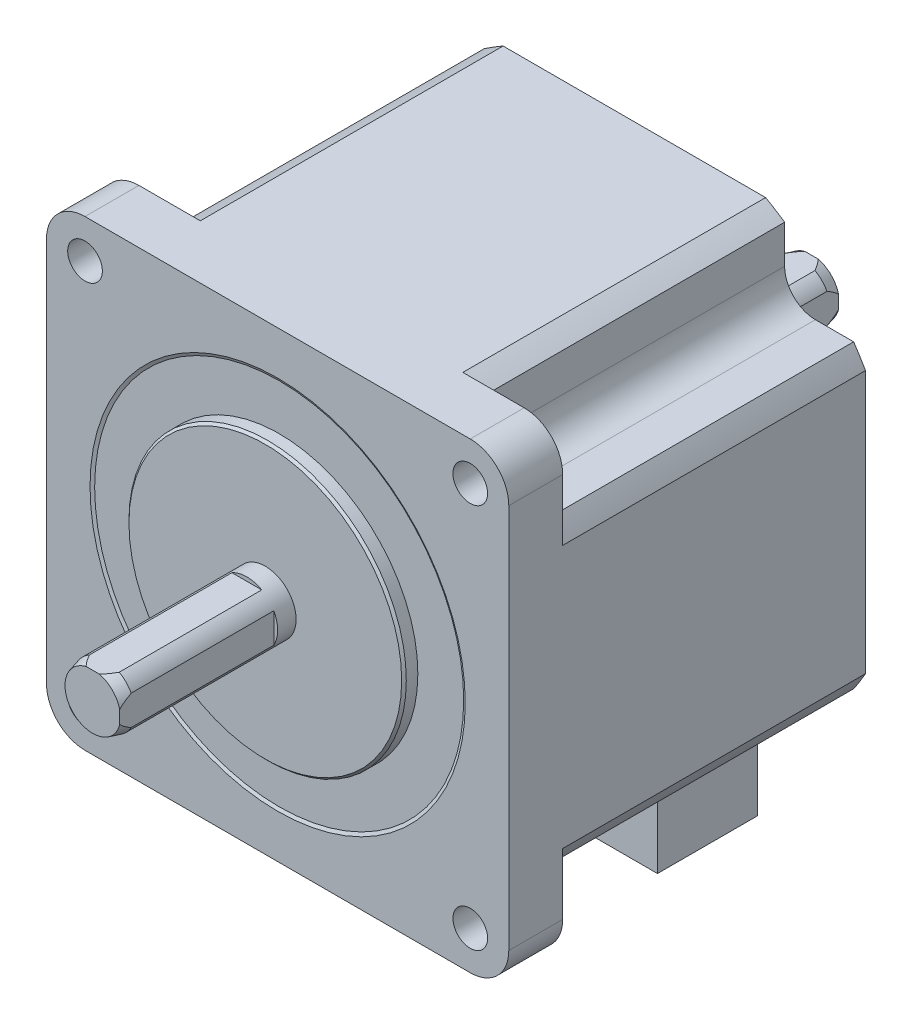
ISO-10303-21;
HEADER;
FILE_DESCRIPTION(('STEP AP214'),'2;1');
FILE_NAME('part.step','',(''),(''),'','','');
FILE_SCHEMA(('AUTOMOTIVE_DESIGN { 1 0 10303 214 1 1 1 1 }'));
ENDSEC;
DATA;
#1=APPLICATION_CONTEXT('core data for automotive mechanical design processes');
#2=APPLICATION_PROTOCOL_DEFINITION('international standard','automotive_design',2000,#1);
#3=PRODUCT_CONTEXT('',#1,'mechanical');
#4=PRODUCT('Part','Part','',(#3));
#5=PRODUCT_RELATED_PRODUCT_CATEGORY('part','',(#4));
#6=PRODUCT_DEFINITION_FORMATION('','',#4);
#7=PRODUCT_DEFINITION_CONTEXT('part definition',#1,'design');
#8=PRODUCT_DEFINITION('design','',#6,#7);
#9=PRODUCT_DEFINITION_SHAPE('','',#8);
#10=(LENGTH_UNIT() NAMED_UNIT(*) SI_UNIT(.MILLI.,.METRE.));
#11=(NAMED_UNIT(*) PLANE_ANGLE_UNIT() SI_UNIT($,.RADIAN.));
#12=(NAMED_UNIT(*) SI_UNIT($,.STERADIAN.) SOLID_ANGLE_UNIT());
#13=UNCERTAINTY_MEASURE_WITH_UNIT(LENGTH_MEASURE(1.E-05),#10,'distance_accuracy_value','');
#14=(GEOMETRIC_REPRESENTATION_CONTEXT(3) GLOBAL_UNCERTAINTY_ASSIGNED_CONTEXT((#13)) GLOBAL_UNIT_ASSIGNED_CONTEXT((#10,
#11,#12)) REPRESENTATION_CONTEXT('',''));
#15=CARTESIAN_POINT('',(0.,0.,0.));
#16=DIRECTION('',(0.,0.,1.));
#17=DIRECTION('',(1.,0.,0.));
#18=AXIS2_PLACEMENT_3D('',#15,#16,#17);
#19=CARTESIAN_POINT('',(0.,0.,-47.9));
#20=DIRECTION('',(0.,0.,-1.));
#21=DIRECTION('',(-1.,0.,0.));
#22=AXIS2_PLACEMENT_3D('',#19,#20,#21);
#23=PLANE('',#22);
#24=DIRECTION('',(0.,1.,0.));
#25=VECTOR('',#24,1.);
#26=CARTESIAN_POINT('',(-30.,0.,-47.9));
#27=LINE('',#26,#25);
#28=CARTESIAN_POINT('',(-30.,-17.0367250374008,-47.9));
#29=VERTEX_POINT('',#28);
#30=CARTESIAN_POINT('',(-30.,17.0367250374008,-47.9));
#31=VERTEX_POINT('',#30);
#32=EDGE_CURVE('E437',#29,#31,#27,.T.);
#33=ORIENTED_EDGE('',*,*,#32,.T.);
#34=CARTESIAN_POINT('',(0.,0.,-47.9));
#35=DIRECTION('',(0.,0.,-1.));
#36=DIRECTION('',(-1.,0.,0.));
#37=AXIS2_PLACEMENT_3D('',#34,#35,#36);
#38=CIRCLE('',#37,34.5);
#39=CARTESIAN_POINT('',(-28.4604989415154,19.5,-47.9));
#40=VERTEX_POINT('',#39);
#41=EDGE_CURVE('E440',#31,#40,#38,.T.);
#42=ORIENTED_EDGE('',*,*,#41,.T.);
#43=DIRECTION('',(-1.,0.,0.));
#44=VECTOR('',#43,1.);
#45=CARTESIAN_POINT('',(0.,19.5000000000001,-47.9));
#46=LINE('',#45,#44);
#47=CARTESIAN_POINT('',(-23.5,19.5,-47.9));
#48=VERTEX_POINT('',#47);
#49=EDGE_CURVE('E444',#48,#40,#46,.T.);
#50=ORIENTED_EDGE('',*,*,#49,.F.);
#51=CARTESIAN_POINT('',(-23.5,23.5,-47.9));
#52=DIRECTION('',(0.,0.,-1.));
#53=DIRECTION('',(-1.,0.,0.));
#54=AXIS2_PLACEMENT_3D('',#51,#52,#53);
#55=CIRCLE('',#54,4.);
#56=CARTESIAN_POINT('',(-19.5,23.5,-47.9));
#57=VERTEX_POINT('',#56);
#58=EDGE_CURVE('E568',#48,#57,#55,.F.);
#59=ORIENTED_EDGE('',*,*,#58,.T.);
#60=DIRECTION('',(0.,-1.,0.));
#61=VECTOR('',#60,1.);
#62=CARTESIAN_POINT('',(-19.5,0.,-47.9));
#63=LINE('',#62,#61);
#64=CARTESIAN_POINT('',(-19.5,28.4604989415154,-47.9));
#65=VERTEX_POINT('',#64);
#66=EDGE_CURVE('E448',#65,#57,#63,.T.);
#67=ORIENTED_EDGE('',*,*,#66,.F.);
#68=CARTESIAN_POINT('',(-17.0367250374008,30.,-47.9));
#69=VERTEX_POINT('',#68);
#70=EDGE_CURVE('E446',#65,#69,#38,.T.);
#71=ORIENTED_EDGE('',*,*,#70,.T.);
#72=DIRECTION('',(1.,0.,0.));
#73=VECTOR('',#72,1.);
#74=CARTESIAN_POINT('',(0.,30.,-47.9));
#75=LINE('',#74,#73);
#76=CARTESIAN_POINT('',(17.0367250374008,30.,-47.9));
#77=VERTEX_POINT('',#76);
#78=EDGE_CURVE('E451',#69,#77,#75,.T.);
#79=ORIENTED_EDGE('',*,*,#78,.T.);
#80=CARTESIAN_POINT('',(19.5,28.4604989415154,-47.9));
#81=VERTEX_POINT('',#80);
#82=EDGE_CURVE('E453',#77,#81,#38,.T.);
#83=ORIENTED_EDGE('',*,*,#82,.T.);
#84=DIRECTION('',(0.,-1.,0.));
#85=VECTOR('',#84,1.);
#86=CARTESIAN_POINT('',(19.5,0.,-47.9));
#87=LINE('',#86,#85);
#88=CARTESIAN_POINT('',(19.5,23.5,-47.9));
#89=VERTEX_POINT('',#88);
#90=EDGE_CURVE('E454',#81,#89,#87,.T.);
#91=ORIENTED_EDGE('',*,*,#90,.T.);
#92=CARTESIAN_POINT('',(23.5,23.5,-47.9));
#93=DIRECTION('',(0.,0.,-1.));
#94=DIRECTION('',(-1.,0.,0.));
#95=AXIS2_PLACEMENT_3D('',#92,#93,#94);
#96=CIRCLE('',#95,4.);
#97=CARTESIAN_POINT('',(23.5,19.5,-47.9));
#98=VERTEX_POINT('',#97);
#99=EDGE_CURVE('E570',#89,#98,#96,.F.);
#100=ORIENTED_EDGE('',*,*,#99,.T.);
#101=DIRECTION('',(-1.,0.,0.));
#102=VECTOR('',#101,1.);
#103=CARTESIAN_POINT('',(0.,19.5000000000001,-47.9));
#104=LINE('',#103,#102);
#105=CARTESIAN_POINT('',(28.4604989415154,19.5,-47.9));
#106=VERTEX_POINT('',#105);
#107=EDGE_CURVE('E457',#106,#98,#104,.T.);
#108=ORIENTED_EDGE('',*,*,#107,.F.);
#109=CARTESIAN_POINT('',(30.,17.0367250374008,-47.9));
#110=VERTEX_POINT('',#109);
#111=EDGE_CURVE('E460',#106,#110,#38,.T.);
#112=ORIENTED_EDGE('',*,*,#111,.T.);
#113=DIRECTION('',(0.,-1.,0.));
#114=VECTOR('',#113,1.);
#115=CARTESIAN_POINT('',(30.,0.,-47.9));
#116=LINE('',#115,#114);
#117=CARTESIAN_POINT('',(30.,-17.0367250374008,-47.9));
#118=VERTEX_POINT('',#117);
#119=EDGE_CURVE('E461',#110,#118,#116,.T.);
#120=ORIENTED_EDGE('',*,*,#119,.T.);
#121=CARTESIAN_POINT('',(28.4604989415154,-19.5,-47.9));
#122=VERTEX_POINT('',#121);
#123=EDGE_CURVE('E463',#118,#122,#38,.T.);
#124=ORIENTED_EDGE('',*,*,#123,.T.);
#125=DIRECTION('',(-1.,0.,0.));
#126=VECTOR('',#125,1.);
#127=CARTESIAN_POINT('',(0.,-19.4999999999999,-47.9));
#128=LINE('',#127,#126);
#129=CARTESIAN_POINT('',(23.5,-19.5,-47.9));
#130=VERTEX_POINT('',#129);
#131=EDGE_CURVE('E464',#122,#130,#128,.T.);
#132=ORIENTED_EDGE('',*,*,#131,.T.);
#133=CARTESIAN_POINT('',(23.5,-23.5,-47.9));
#134=DIRECTION('',(0.,0.,-1.));
#135=DIRECTION('',(-1.,0.,0.));
#136=AXIS2_PLACEMENT_3D('',#133,#134,#135);
#137=CIRCLE('',#136,4.);
#138=CARTESIAN_POINT('',(19.5,-23.5,-47.9));
#139=VERTEX_POINT('',#138);
#140=EDGE_CURVE('E564',#130,#139,#137,.F.);
#141=ORIENTED_EDGE('',*,*,#140,.T.);
#142=DIRECTION('',(0.,-1.,0.));
#143=VECTOR('',#142,1.);
#144=CARTESIAN_POINT('',(19.5,0.,-47.9));
#145=LINE('',#144,#143);
#146=CARTESIAN_POINT('',(19.5,-28.4604989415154,-47.9));
#147=VERTEX_POINT('',#146);
#148=EDGE_CURVE('E467',#139,#147,#145,.T.);
#149=ORIENTED_EDGE('',*,*,#148,.T.);
#150=CARTESIAN_POINT('',(17.0367250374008,-30.,-47.9));
#151=VERTEX_POINT('',#150);
#152=EDGE_CURVE('E469',#147,#151,#38,.T.);
#153=ORIENTED_EDGE('',*,*,#152,.T.);
#154=DIRECTION('',(-1.,0.,0.));
#155=VECTOR('',#154,1.);
#156=CARTESIAN_POINT('',(0.,-30.,-47.9));
#157=LINE('',#156,#155);
#158=CARTESIAN_POINT('',(16.,-30.,-47.9));
#159=VERTEX_POINT('',#158);
#160=EDGE_CURVE('E470',#151,#159,#157,.T.);
#161=ORIENTED_EDGE('',*,*,#160,.T.);
#162=DIRECTION('',(0.,1.,0.));
#163=VECTOR('',#162,1.);
#164=CARTESIAN_POINT('',(16.,-40.,-47.9));
#165=LINE('',#164,#163);
#166=CARTESIAN_POINT('',(16.,-40.,-47.9));
#167=VERTEX_POINT('',#166);
#168=EDGE_CURVE('E431',#167,#159,#165,.T.);
#169=ORIENTED_EDGE('',*,*,#168,.F.);
#170=DIRECTION('',(1.,0.,0.));
#171=VECTOR('',#170,1.);
#172=CARTESIAN_POINT('',(-16.,-40.,-47.9));
#173=LINE('',#172,#171);
#174=CARTESIAN_POINT('',(-16.,-40.,-47.9));
#175=VERTEX_POINT('',#174);
#176=EDGE_CURVE('E414',#175,#167,#173,.T.);
#177=ORIENTED_EDGE('',*,*,#176,.F.);
#178=DIRECTION('',(0.,1.,0.));
#179=VECTOR('',#178,1.);
#180=CARTESIAN_POINT('',(-16.,-40.,-47.9));
#181=LINE('',#180,#179);
#182=CARTESIAN_POINT('',(-16.,-30.,-47.9));
#183=VERTEX_POINT('',#182);
#184=EDGE_CURVE('E433',#175,#183,#181,.T.);
#185=ORIENTED_EDGE('',*,*,#184,.T.);
#186=CARTESIAN_POINT('',(-17.0367250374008,-30.,-47.9));
#187=VERTEX_POINT('',#186);
#188=EDGE_CURVE('E474',#183,#187,#157,.T.);
#189=ORIENTED_EDGE('',*,*,#188,.T.);
#190=CARTESIAN_POINT('',(-19.5,-28.4604989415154,-47.9));
#191=VERTEX_POINT('',#190);
#192=EDGE_CURVE('E473',#187,#191,#38,.T.);
#193=ORIENTED_EDGE('',*,*,#192,.T.);
#194=DIRECTION('',(0.,-1.,0.));
#195=VECTOR('',#194,1.);
#196=CARTESIAN_POINT('',(-19.5,0.,-47.9));
#197=LINE('',#196,#195);
#198=CARTESIAN_POINT('',(-19.5,-23.5,-47.9));
#199=VERTEX_POINT('',#198);
#200=EDGE_CURVE('E475',#199,#191,#197,.T.);
#201=ORIENTED_EDGE('',*,*,#200,.F.);
#202=CARTESIAN_POINT('',(-23.5,-23.5,-47.9));
#203=DIRECTION('',(0.,0.,-1.));
#204=DIRECTION('',(-1.,0.,0.));
#205=AXIS2_PLACEMENT_3D('',#202,#203,#204);
#206=CIRCLE('',#205,4.);
#207=CARTESIAN_POINT('',(-23.5,-19.5,-47.9));
#208=VERTEX_POINT('',#207);
#209=EDGE_CURVE('E566',#199,#208,#206,.F.);
#210=ORIENTED_EDGE('',*,*,#209,.T.);
#211=DIRECTION('',(-1.,0.,0.));
#212=VECTOR('',#211,1.);
#213=CARTESIAN_POINT('',(0.,-19.4999999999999,-47.9));
#214=LINE('',#213,#212);
#215=CARTESIAN_POINT('',(-28.4604989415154,-19.5,-47.9));
#216=VERTEX_POINT('',#215);
#217=EDGE_CURVE('E477',#208,#216,#214,.T.);
#218=ORIENTED_EDGE('',*,*,#217,.T.);
#219=EDGE_CURVE('E445',#216,#29,#38,.T.);
#220=ORIENTED_EDGE('',*,*,#219,.T.);
#221=EDGE_LOOP('',(#33,#42,#50,#59,#67,#71,#79,#83,#91,#100,#108,#112,#120,#124,#132,#141,#149,
#153,#161,#169,#177,#185,#189,#193,#201,#210,#218,#220));
#222=FACE_BOUND('',#221,.T.);
#223=CARTESIAN_POINT('',(0.,0.,-47.9));
#224=DIRECTION('',(0.,0.,-1.));
#225=DIRECTION('',(-1.,0.,0.));
#226=AXIS2_PLACEMENT_3D('',#223,#224,#225);
#227=CIRCLE('',#226,4.);
#228=CARTESIAN_POINT('',(-4.,0.,-47.9));
#229=VERTEX_POINT('',#228);
#230=EDGE_CURVE('E378',#229,#229,#227,.T.);
#231=ORIENTED_EDGE('',*,*,#230,.F.);
#232=EDGE_LOOP('',(#231));
#233=FACE_BOUND('',#232,.T.);
#234=ADVANCED_FACE('F39',(#222,#233),#23,.T.);
#235=CARTESIAN_POINT('',(0.,0.,22.4));
#236=DIRECTION('',(0.,0.,-1.));
#237=DIRECTION('',(-1.,0.,0.));
#238=AXIS2_PLACEMENT_3D('',#235,#236,#237);
#239=CONICAL_SURFACE('',#238,3.59807621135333,0.261799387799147);
#240=CARTESIAN_POINT('',(3.5,3.65885881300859,16.9316215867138));
#241=CARTESIAN_POINT('',(3.5,3.60239566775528,17.0838864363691));
#242=CARTESIAN_POINT('',(3.5,3.54539058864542,17.2359490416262));
#243=CARTESIAN_POINT('',(3.5,3.43012170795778,17.539604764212));
#244=CARTESIAN_POINT('',(3.5,3.37185784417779,17.6911978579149));
#245=CARTESIAN_POINT('',(3.5,3.19466893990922,18.1458077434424));
#246=CARTESIAN_POINT('',(3.5,3.07358949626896,18.4479953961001));
#247=CARTESIAN_POINT('',(3.5,2.88202757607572,18.9085831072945));
#248=CARTESIAN_POINT('',(3.5,2.81435636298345,19.0681529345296));
#249=CARTESIAN_POINT('',(3.5,2.67631316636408,19.3861181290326));
#250=CARTESIAN_POINT('',(3.5,2.60594127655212,19.5445135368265));
#251=CARTESIAN_POINT('',(3.5,2.46196785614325,19.8596093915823));
#252=CARTESIAN_POINT('',(3.5,2.3883702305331,20.0163116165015));
#253=CARTESIAN_POINT('',(3.5,2.23702965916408,20.327693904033));
#254=CARTESIAN_POINT('',(3.5,2.15928717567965,20.4823741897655));
#255=CARTESIAN_POINT('',(3.5,1.99956753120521,20.786779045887));
#256=CARTESIAN_POINT('',(3.5,1.91766524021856,20.9365427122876));
#257=CARTESIAN_POINT('',(3.5,1.74677024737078,21.2323903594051));
#258=CARTESIAN_POINT('',(3.5,1.65776561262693,21.3784675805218));
#259=CARTESIAN_POINT('',(3.5,1.51770774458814,21.5916740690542));
#260=CARTESIAN_POINT('',(3.5,1.47033809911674,21.6612195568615));
#261=CARTESIAN_POINT('',(3.5,1.37275172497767,21.7982748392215));
#262=CARTESIAN_POINT('',(3.5,1.32253564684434,21.8657850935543));
#263=CARTESIAN_POINT('',(3.5,1.21878037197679,21.997919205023));
#264=CARTESIAN_POINT('',(3.5,1.16525083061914,22.0625505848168));
#265=CARTESIAN_POINT('',(3.5,1.05398107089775,22.1880495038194));
#266=CARTESIAN_POINT('',(3.5,0.996243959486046,22.2489197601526));
#267=CARTESIAN_POINT('',(3.5,0.879074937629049,22.3618808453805));
#268=CARTESIAN_POINT('',(3.5,0.819941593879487,22.4142773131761));
#269=CARTESIAN_POINT('',(3.5,0.696050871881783,22.5121419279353));
#270=CARTESIAN_POINT('',(3.5,0.631293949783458,22.5576106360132));
#271=CARTESIAN_POINT('',(3.5,0.507273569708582,22.6311614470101));
#272=CARTESIAN_POINT('',(3.5,0.449006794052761,22.6608914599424));
#273=CARTESIAN_POINT('',(3.5,0.328412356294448,22.7105403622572));
#274=CARTESIAN_POINT('',(3.5,0.266093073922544,22.7304788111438));
#275=CARTESIAN_POINT('',(3.5,0.149648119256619,22.7555691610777));
#276=CARTESIAN_POINT('',(3.5,0.0959490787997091,22.7626698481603));
#277=CARTESIAN_POINT('',(3.5,-0.011869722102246,22.7674965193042));
#278=CARTESIAN_POINT('',(3.5,-0.0659893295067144,22.7652257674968));
#279=CARTESIAN_POINT('',(3.5,-0.172879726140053,22.7516191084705));
#280=CARTESIAN_POINT('',(3.5,-0.225653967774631,22.7403094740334));
#281=CARTESIAN_POINT('',(3.5,-0.328872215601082,22.7098978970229));
#282=CARTESIAN_POINT('',(3.5,-0.379314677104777,22.6907908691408));
#283=CARTESIAN_POINT('',(3.5,-0.508714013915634,22.6321380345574));
#284=CARTESIAN_POINT('',(3.5,-0.585263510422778,22.5873371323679));
#285=CARTESIAN_POINT('',(3.5,-0.730938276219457,22.4869137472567));
#286=CARTESIAN_POINT('',(3.5,-0.800033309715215,22.4312495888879));
#287=CARTESIAN_POINT('',(3.5,-0.955746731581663,22.2916879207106));
#288=CARTESIAN_POINT('',(3.5,-1.0396891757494,22.2048513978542));
#289=CARTESIAN_POINT('',(3.5,-1.19908801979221,22.0236161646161));
#290=CARTESIAN_POINT('',(3.5,-1.27452504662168,21.9292009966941));
#291=CARTESIAN_POINT('',(3.5,-1.41979524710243,21.7344953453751));
#292=CARTESIAN_POINT('',(3.5,-1.48955344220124,21.6341495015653));
#293=CARTESIAN_POINT('',(3.5,-1.62395149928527,21.4302869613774));
#294=CARTESIAN_POINT('',(3.5,-1.68859694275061,21.3267738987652));
#295=CARTESIAN_POINT('',(3.5,-1.85613404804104,21.0470251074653));
#296=CARTESIAN_POINT('',(3.5,-1.95551266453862,20.868694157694));
#297=CARTESIAN_POINT('',(3.5,-2.1466553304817,20.5079710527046));
#298=CARTESIAN_POINT('',(3.5,-2.23841606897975,20.3255771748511));
#299=CARTESIAN_POINT('',(3.5,-2.41645935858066,19.9576498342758));
#300=CARTESIAN_POINT('',(3.5,-2.50272932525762,19.7721103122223));
#301=CARTESIAN_POINT('',(3.5,-2.6709013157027,19.3990599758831));
#302=CARTESIAN_POINT('',(3.5,-2.75280305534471,19.2115490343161));
#303=CARTESIAN_POINT('',(3.5,-2.90658898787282,18.8504519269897));
#304=CARTESIAN_POINT('',(3.5,-2.97874468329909,18.6769809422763));
#305=CARTESIAN_POINT('',(3.5,-3.1206556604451,18.3290502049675));
#306=CARTESIAN_POINT('',(3.5,-3.19041080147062,18.1545903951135));
#307=CARTESIAN_POINT('',(3.5,-3.32757858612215,17.8057332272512));
#308=CARTESIAN_POINT('',(3.5,-3.3950009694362,17.6313396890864));
#309=CARTESIAN_POINT('',(3.5,-3.52813716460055,17.2819241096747));
#310=CARTESIAN_POINT('',(3.5,-3.59385117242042,17.1069021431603));
#311=CARTESIAN_POINT('',(3.5,-3.65885881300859,16.9316215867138));
#312=B_SPLINE_CURVE_WITH_KNOTS('',3,(#240,#241,#242,#243,#244,#245,#246,#247,#248,#249,#250,
#251,#252,#253,#254,#255,#256,#257,#258,#259,#260,#261,#262,#263,#264,#265,#266,#267,#268,#269,
#270,#271,#272,#273,#274,#275,#276,#277,#278,#279,#280,#281,#282,#283,#284,#285,#286,#287,#288,
#289,#290,#291,#292,#293,#294,#295,#296,#297,#298,#299,#300,#301,#302,#303,#304,#305,#306,#307,
#308,#309,#310,#311),.UNSPECIFIED.,.F.,.F.,(4,2,2,2,2,2,2,2,2,2,2,2,2,2,2,2,2,2,2,2,2,2,2,2,2,2,
2,2,2,2,2,2,2,2,2,4),(0.,0.487185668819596,0.974395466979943,1.95092394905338,2.47088362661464,
2.99082527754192,3.51015400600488,4.0294249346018,4.54139798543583,5.0542501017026,
5.30663191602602,5.55895628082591,5.81057715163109,6.0620140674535,6.29868754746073,
6.53534184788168,6.73093008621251,6.92612601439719,7.08786234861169,7.24954235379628,
7.4107541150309,7.5720711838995,7.83661046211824,8.10218530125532,8.46361083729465,
8.82584364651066,9.19226963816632,9.55828992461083,10.1704387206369,10.7828521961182,
11.3966221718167,12.0104320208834,12.574048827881,13.1376986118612,13.6986081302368,
14.2594530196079),.UNSPECIFIED.);
#313=CARTESIAN_POINT('',(3.5,1.93649167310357,20.9000000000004));
#314=VERTEX_POINT('',#313);
#315=CARTESIAN_POINT('',(3.5,0.834357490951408,22.4));
#316=VERTEX_POINT('',#315);
#317=EDGE_CURVE('E1505',#314,#316,#312,.T.);
#318=ORIENTED_EDGE('',*,*,#317,.F.);
#319=CARTESIAN_POINT('',(0.,0.,20.9));
#320=DIRECTION('',(0.,0.,1.));
#321=DIRECTION('',(1.,0.,0.));
#322=AXIS2_PLACEMENT_3D('',#319,#320,#321);
#323=CIRCLE('',#322,4.);
#324=CARTESIAN_POINT('',(1.93649167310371,3.5,20.9));
#325=VERTEX_POINT('',#324);
#326=EDGE_CURVE('E577',#325,#314,#323,.F.);
#327=ORIENTED_EDGE('',*,*,#326,.F.);
#328=CARTESIAN_POINT('',(-3.86930929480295,3.5,16.3564970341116));
#329=CARTESIAN_POINT('',(-3.8113068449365,3.5,16.5170199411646));
#330=CARTESIAN_POINT('',(-3.75279353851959,3.5,16.6773588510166));
#331=CARTESIAN_POINT('',(-3.63458077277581,3.5,16.9976052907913));
#332=CARTESIAN_POINT('',(-3.57488126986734,3.5,17.1575128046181));
#333=CARTESIAN_POINT('',(-3.39361030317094,3.5,17.6368798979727));
#334=CARTESIAN_POINT('',(-3.27001249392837,3.5,17.9555770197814));
#335=CARTESIAN_POINT('',(-3.01244232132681,3.5,18.5978750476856));
#336=CARTESIAN_POINT('',(-2.8782898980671,3.5,18.9214046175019));
#337=CARTESIAN_POINT('',(-2.66885480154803,3.5,19.4030223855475));
#338=CARTESIAN_POINT('',(-2.59769761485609,3.5,19.5629021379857));
#339=CARTESIAN_POINT('',(-2.45197127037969,3.5,19.8810939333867));
#340=CARTESIAN_POINT('',(-2.37740232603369,3.5,20.0394060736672));
#341=CARTESIAN_POINT('',(-2.22441816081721,3.5,20.3530265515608));
#342=CARTESIAN_POINT('',(-2.14602805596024,3.5,20.5083470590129));
#343=CARTESIAN_POINT('',(-1.98368792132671,3.5,20.816207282));
#344=CARTESIAN_POINT('',(-1.89973412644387,3.5,20.9687450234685));
#345=CARTESIAN_POINT('',(-1.72475802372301,3.5,21.2690282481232));
#346=CARTESIAN_POINT('',(-1.63376343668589,3.5,21.4167895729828));
#347=CARTESIAN_POINT('',(-1.48957033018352,3.5,21.6332031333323));
#348=CARTESIAN_POINT('',(-1.44025385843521,3.5,21.7044290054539));
#349=CARTESIAN_POINT('',(-1.33846826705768,3.5,21.8445807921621));
#350=CARTESIAN_POINT('',(-1.28599919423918,3.5,21.913506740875));
#351=CARTESIAN_POINT('',(-1.15028154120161,3.5,22.0816859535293));
#352=CARTESIAN_POINT('',(-1.06463830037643,3.5,22.1790896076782));
#353=CARTESIAN_POINT('',(-0.927427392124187,3.5,22.3162128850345));
#354=CARTESIAN_POINT('',(-0.880306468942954,3.5,22.3603667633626));
#355=CARTESIAN_POINT('',(-0.782611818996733,3.5,22.4446415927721));
#356=CARTESIAN_POINT('',(-0.732041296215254,3.5,22.4847662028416));
#357=CARTESIAN_POINT('',(-0.626326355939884,3.5,22.5599557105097));
#358=CARTESIAN_POINT('',(-0.571136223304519,3.5,22.5949574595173));
#359=CARTESIAN_POINT('',(-0.456439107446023,3.5,22.6571140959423));
#360=CARTESIAN_POINT('',(-0.396936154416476,3.5,22.6842761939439));
#361=CARTESIAN_POINT('',(-0.282931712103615,3.5,22.7248685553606));
#362=CARTESIAN_POINT('',(-0.228944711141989,3.5,22.7397133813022));
#363=CARTESIAN_POINT('',(-0.119250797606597,3.5,22.7600378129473));
#364=CARTESIAN_POINT('',(-0.0635463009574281,3.5,22.7655300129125));
#365=CARTESIAN_POINT('',(0.0480719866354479,3.5,22.7664569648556));
#366=CARTESIAN_POINT('',(0.103985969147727,3.5,22.7618697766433));
#367=CARTESIAN_POINT('',(0.214216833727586,3.5,22.7432034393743));
#368=CARTESIAN_POINT('',(0.26853159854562,3.5,22.7291122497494));
#369=CARTESIAN_POINT('',(0.392914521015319,3.5,22.6866590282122));
#370=CARTESIAN_POINT('',(0.461848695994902,3.5,22.6550295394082));
#371=CARTESIAN_POINT('',(0.593979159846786,3.5,22.5815220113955));
#372=CARTESIAN_POINT('',(0.657160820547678,3.5,22.5396187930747));
#373=CARTESIAN_POINT('',(0.775505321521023,3.5,22.4508929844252));
#374=CARTESIAN_POINT('',(0.830900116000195,3.5,22.4043731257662));
#375=CARTESIAN_POINT('',(0.937609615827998,3.5,22.3068263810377));
#376=CARTESIAN_POINT('',(0.988920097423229,3.5,22.2557949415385));
#377=CARTESIAN_POINT('',(1.08824660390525,3.5,22.1503476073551));
#378=CARTESIAN_POINT('',(1.13625167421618,3.5,22.0959215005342));
#379=CARTESIAN_POINT('',(1.22933749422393,3.5,21.9846920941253));
#380=CARTESIAN_POINT('',(1.27441975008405,3.5,21.9278900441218));
#381=CARTESIAN_POINT('',(1.40470096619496,3.5,21.7565363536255));
#382=CARTESIAN_POINT('',(1.48644178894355,3.5,21.6393610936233));
#383=CARTESIAN_POINT('',(1.64319201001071,3.5,21.4005598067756));
#384=CARTESIAN_POINT('',(1.71819627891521,3.5,21.2789304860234));
#385=CARTESIAN_POINT('',(1.86323185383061,3.5,21.0323940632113));
#386=CARTESIAN_POINT('',(1.93325170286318,3.5,20.9074802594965));
#387=CARTESIAN_POINT('',(2.06928175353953,3.5,20.6554785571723));
#388=CARTESIAN_POINT('',(2.13529130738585,3.5,20.5283903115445));
#389=CARTESIAN_POINT('',(2.26442116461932,3.5,20.2719514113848));
#390=CARTESIAN_POINT('',(2.32752509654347,3.5,20.1425925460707));
#391=CARTESIAN_POINT('',(2.45107743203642,3.5,19.882609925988));
#392=CARTESIAN_POINT('',(2.51152569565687,3.5,19.7519861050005));
#393=CARTESIAN_POINT('',(2.6894180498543,3.5,19.3589924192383));
#394=CARTESIAN_POINT('',(2.8035874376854,3.5,19.0951401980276));
#395=CARTESIAN_POINT('',(3.00048591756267,3.5,18.6248626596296));
#396=CARTESIAN_POINT('',(3.08448097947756,3.5,18.4189605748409));
#397=CARTESIAN_POINT('',(3.24945704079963,3.5,18.0058641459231));
#398=CARTESIAN_POINT('',(3.33043691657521,3.5,17.7986693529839));
#399=CARTESIAN_POINT('',(3.48887984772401,3.5,17.3860176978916));
#400=CARTESIAN_POINT('',(3.56637485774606,3.5,17.1805730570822));
#401=CARTESIAN_POINT('',(3.71929183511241,3.5,16.7690161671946));
#402=CARTESIAN_POINT('',(3.79471470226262,3.5,16.5629042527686));
#403=CARTESIAN_POINT('',(3.86930929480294,3.5,16.3564970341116));
#404=B_SPLINE_CURVE_WITH_KNOTS('',3,(#328,#329,#330,#331,#332,#333,#334,#335,#336,#337,#338,
#339,#340,#341,#342,#343,#344,#345,#346,#347,#348,#349,#350,#351,#352,#353,#354,#355,#356,#357,
#358,#359,#360,#361,#362,#363,#364,#365,#366,#367,#368,#369,#370,#371,#372,#373,#374,#375,#376,
#377,#378,#379,#380,#381,#382,#383,#384,#385,#386,#387,#388,#389,#390,#391,#392,#393,#394,#395,
#396,#397,#398,#399,#400,#401,#402,#403),.UNSPECIFIED.,.F.,.F.,(4,2,2,2,2,2,2,2,2,2,2,2,2,2,2,2,
2,2,2,2,2,2,2,2,2,2,2,2,2,2,2,2,2,2,2,2,2,4),(0.,0.512041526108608,1.02410189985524,
2.04951981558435,3.10007779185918,3.62504636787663,4.14998214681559,4.67184000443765,
5.19405469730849,5.71430882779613,5.97412878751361,6.2339448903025,6.62218502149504,
6.81575137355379,7.00914032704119,7.20474211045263,7.40016340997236,7.56743042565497,
7.73447202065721,7.90187758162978,8.06949562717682,8.29573563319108,8.52253575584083,
8.73922123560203,8.95612796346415,9.17372201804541,9.39120303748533,9.81942658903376,
10.247973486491,10.6774755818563,11.1070468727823,11.5387992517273,11.9705743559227,
12.8329204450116,13.500025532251,14.1673767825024,14.8260894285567,15.4845113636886),.UNSPECIFIED.);
#405=CARTESIAN_POINT('',(0.834357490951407,3.5,22.4));
#406=VERTEX_POINT('',#405);
#407=EDGE_CURVE('E580',#406,#325,#404,.T.);
#408=ORIENTED_EDGE('',*,*,#407,.F.);
#409=CARTESIAN_POINT('',(0.,0.,22.4));
#410=DIRECTION('',(0.,0.,1.));
#411=DIRECTION('',(1.,0.,0.));
#412=AXIS2_PLACEMENT_3D('',#409,#410,#411);
#413=CIRCLE('',#412,3.59807621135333);
#414=EDGE_CURVE('E572',#316,#406,#413,.T.);
#415=ORIENTED_EDGE('',*,*,#414,.F.);
#416=EDGE_LOOP('',(#318,#327,#408,#415));
#417=FACE_BOUND('',#416,.T.);
#418=ADVANCED_FACE('F625',(#417),#239,.T.);
#419=CARTESIAN_POINT('',(0.,0.,22.4));
#420=DIRECTION('',(0.,0.,-1.));
#421=DIRECTION('',(-1.,0.,0.));
#422=AXIS2_PLACEMENT_3D('',#419,#420,#421);
#423=CYLINDRICAL_SURFACE('',#422,4.);
#424=ORIENTED_EDGE('',*,*,#326,.T.);
#425=DIRECTION('',(0.,0.,-1.));
#426=VECTOR('',#425,1.);
#427=CARTESIAN_POINT('',(3.5,1.93649167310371,22.4));
#428=LINE('',#427,#426);
#429=CARTESIAN_POINT('',(3.5,1.93649167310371,2.4));
#430=VERTEX_POINT('',#429);
#431=EDGE_CURVE('E395',#314,#430,#428,.T.);
#432=ORIENTED_EDGE('',*,*,#431,.T.);
#433=CARTESIAN_POINT('',(0.,0.,2.4));
#434=DIRECTION('',(0.,0.,-1.));
#435=DIRECTION('',(-1.,0.,0.));
#436=AXIS2_PLACEMENT_3D('',#433,#434,#435);
#437=CIRCLE('',#436,4.);
#438=CARTESIAN_POINT('',(3.5,-1.93649167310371,2.4));
#439=VERTEX_POINT('',#438);
#440=EDGE_CURVE('E1506',#430,#439,#437,.T.);
#441=ORIENTED_EDGE('',*,*,#440,.T.);
#442=DIRECTION('',(0.,0.,-1.));
#443=VECTOR('',#442,1.);
#444=CARTESIAN_POINT('',(3.5,-1.93649167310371,22.4));
#445=LINE('',#444,#443);
#446=CARTESIAN_POINT('',(3.5,-1.93649167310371,20.9));
#447=VERTEX_POINT('',#446);
#448=EDGE_CURVE('E391',#439,#447,#445,.F.);
#449=ORIENTED_EDGE('',*,*,#448,.T.);
#450=CARTESIAN_POINT('',(-1.93649167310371,3.5,20.9));
#451=VERTEX_POINT('',#450);
#452=EDGE_CURVE('E576',#447,#451,#323,.F.);
#453=ORIENTED_EDGE('',*,*,#452,.T.);
#454=DIRECTION('',(0.,0.,-1.));
#455=VECTOR('',#454,1.);
#456=CARTESIAN_POINT('',(-1.93649167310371,3.5,22.4));
#457=LINE('',#456,#455);
#458=CARTESIAN_POINT('',(-1.93649167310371,3.5,2.4));
#459=VERTEX_POINT('',#458);
#460=EDGE_CURVE('E407',#451,#459,#457,.T.);
#461=ORIENTED_EDGE('',*,*,#460,.T.);
#462=CARTESIAN_POINT('',(0.,0.,2.4));
#463=DIRECTION('',(0.,0.,1.));
#464=DIRECTION('',(1.,0.,0.));
#465=AXIS2_PLACEMENT_3D('',#462,#463,#464);
#466=CIRCLE('',#465,4.);
#467=CARTESIAN_POINT('',(1.93649167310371,3.5,2.4));
#468=VERTEX_POINT('',#467);
#469=EDGE_CURVE('E588',#468,#459,#466,.T.);
#470=ORIENTED_EDGE('',*,*,#469,.F.);
#471=DIRECTION('',(0.,0.,-1.));
#472=VECTOR('',#471,1.);
#473=CARTESIAN_POINT('',(1.93649167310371,3.5,22.4));
#474=LINE('',#473,#472);
#475=EDGE_CURVE('E402',#468,#325,#474,.F.);
#476=ORIENTED_EDGE('',*,*,#475,.T.);
#477=EDGE_LOOP('',(#424,#432,#441,#449,#453,#461,#470,#476));
#478=FACE_BOUND('',#477,.T.);
#479=CARTESIAN_POINT('',(0.,0.,0.));
#480=DIRECTION('',(0.,0.,-1.));
#481=DIRECTION('',(-1.,0.,0.));
#482=AXIS2_PLACEMENT_3D('',#479,#480,#481);
#483=CIRCLE('',#482,4.);
#484=CARTESIAN_POINT('',(-4.,0.,0.));
#485=VERTEX_POINT('',#484);
#486=EDGE_CURVE('E878',#485,#485,#483,.T.);
#487=ORIENTED_EDGE('',*,*,#486,.F.);
#488=EDGE_LOOP('',(#487));
#489=FACE_BOUND('',#488,.T.);
#490=ADVANCED_FACE('F728',(#478,#489),#423,.T.);
#491=CARTESIAN_POINT('',(0.,0.,22.4));
#492=DIRECTION('',(0.,0.,1.));
#493=DIRECTION('',(1.,0.,0.));
#494=AXIS2_PLACEMENT_3D('',#491,#492,#493);
#495=PLANE('',#494);
#496=DIRECTION('',(0.,-1.,0.));
#497=VECTOR('',#496,1.);
#498=CARTESIAN_POINT('',(3.5,2.44128177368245,22.4));
#499=LINE('',#498,#497);
#500=CARTESIAN_POINT('',(3.5,-0.834357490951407,22.4));
#501=VERTEX_POINT('',#500);
#502=EDGE_CURVE('E387',#316,#501,#499,.T.);
#503=ORIENTED_EDGE('',*,*,#502,.F.);
#504=ORIENTED_EDGE('',*,*,#414,.T.);
#505=DIRECTION('',(1.,0.,0.));
#506=VECTOR('',#505,1.);
#507=CARTESIAN_POINT('',(-4.72781232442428,3.5,22.4));
#508=LINE('',#507,#506);
#509=CARTESIAN_POINT('',(-0.834357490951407,3.5,22.4));
#510=VERTEX_POINT('',#509);
#511=EDGE_CURVE('E398',#510,#406,#508,.T.);
#512=ORIENTED_EDGE('',*,*,#511,.F.);
#513=EDGE_CURVE('E573',#510,#501,#413,.T.);
#514=ORIENTED_EDGE('',*,*,#513,.T.);
#515=EDGE_LOOP('',(#503,#504,#512,#514));
#516=FACE_BOUND('',#515,.T.);
#517=ADVANCED_FACE('F721',(#516),#495,.T.);
#518=CARTESIAN_POINT('',(0.,0.,0.));
#519=DIRECTION('',(0.,0.,-1.));
#520=DIRECTION('',(-1.,0.,0.));
#521=AXIS2_PLACEMENT_3D('',#518,#519,#520);
#522=PLANE('',#521);
#523=CARTESIAN_POINT('',(0.,0.,0.));
#524=DIRECTION('',(0.,0.,-1.));
#525=DIRECTION('',(-1.,0.,0.));
#526=AXIS2_PLACEMENT_3D('',#523,#524,#525);
#527=CIRCLE('',#526,17.7);
#528=CARTESIAN_POINT('',(-17.7,0.,0.));
#529=VERTEX_POINT('',#528);
#530=EDGE_CURVE('E1512',#529,#529,#527,.F.);
#531=ORIENTED_EDGE('',*,*,#530,.T.);
#532=EDGE_LOOP('',(#531));
#533=FACE_BOUND('',#532,.T.);
#534=ORIENTED_EDGE('',*,*,#486,.T.);
#535=EDGE_LOOP('',(#534));
#536=FACE_BOUND('',#535,.T.);
#537=ADVANCED_FACE('F717',(#533,#536),#522,.F.);
#538=CARTESIAN_POINT('',(0.,0.,-1.6));
#539=DIRECTION('',(0.,0.,1.));
#540=DIRECTION('',(1.,0.,0.));
#541=AXIS2_PLACEMENT_3D('',#538,#539,#540);
#542=CYLINDRICAL_SURFACE('',#541,18.);
#543=CARTESIAN_POINT('',(0.,0.,-0.300000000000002));
#544=DIRECTION('',(0.,0.,-1.));
#545=DIRECTION('',(-1.,0.,0.));
#546=AXIS2_PLACEMENT_3D('',#543,#544,#545);
#547=CIRCLE('',#546,18.);
#548=CARTESIAN_POINT('',(-18.,0.,-0.300000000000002));
#549=VERTEX_POINT('',#548);
#550=EDGE_CURVE('E1509',#549,#549,#547,.T.);
#551=ORIENTED_EDGE('',*,*,#550,.T.);
#552=EDGE_LOOP('',(#551));
#553=FACE_BOUND('',#552,.T.);
#554=CARTESIAN_POINT('',(0.,0.,-1.8));
#555=DIRECTION('',(0.,0.,1.));
#556=DIRECTION('',(1.,0.,0.));
#557=AXIS2_PLACEMENT_3D('',#554,#555,#556);
#558=CIRCLE('',#557,18.);
#559=CARTESIAN_POINT('',(18.,0.,-1.8));
#560=VERTEX_POINT('',#559);
#561=EDGE_CURVE('E381',#560,#560,#558,.T.);
#562=ORIENTED_EDGE('',*,*,#561,.T.);
#563=EDGE_LOOP('',(#562));
#564=FACE_BOUND('',#563,.T.);
#565=ADVANCED_FACE('F720',(#553,#564),#542,.T.);
#566=EDGE_CURVE('E1500',#501,#447,#312,.T.);
#567=ORIENTED_EDGE('',*,*,#566,.F.);
#568=ORIENTED_EDGE('',*,*,#513,.F.);
#569=EDGE_CURVE('E587',#451,#510,#404,.T.);
#570=ORIENTED_EDGE('',*,*,#569,.F.);
#571=ORIENTED_EDGE('',*,*,#452,.F.);
#572=EDGE_LOOP('',(#567,#568,#570,#571));
#573=FACE_BOUND('',#572,.T.);
#574=ADVANCED_FACE('F590',(#573),#239,.T.);
#575=CARTESIAN_POINT('',(0.,0.,2.4));
#576=DIRECTION('',(0.,0.,1.));
#577=DIRECTION('',(1.,0.,0.));
#578=AXIS2_PLACEMENT_3D('',#575,#576,#577);
#579=PLANE('',#578);
#580=ORIENTED_EDGE('',*,*,#469,.T.);
#581=DIRECTION('',(1.,0.,0.));
#582=VECTOR('',#581,1.);
#583=CARTESIAN_POINT('',(-4.72781232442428,3.5,2.4));
#584=LINE('',#583,#582);
#585=EDGE_CURVE('E399',#459,#468,#584,.T.);
#586=ORIENTED_EDGE('',*,*,#585,.T.);
#587=EDGE_LOOP('',(#580,#586));
#588=FACE_BOUND('',#587,.T.);
#589=ADVANCED_FACE('F600',(#588),#579,.T.);
#590=CARTESIAN_POINT('',(-4.72781232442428,3.5,2.4));
#591=DIRECTION('',(0.,-1.,0.));
#592=DIRECTION('',(0.,0.,-1.));
#593=AXIS2_PLACEMENT_3D('',#590,#591,#592);
#594=PLANE('',#593);
#595=ORIENTED_EDGE('',*,*,#569,.T.);
#596=ORIENTED_EDGE('',*,*,#511,.T.);
#597=ORIENTED_EDGE('',*,*,#407,.T.);
#598=ORIENTED_EDGE('',*,*,#475,.F.);
#599=ORIENTED_EDGE('',*,*,#585,.F.);
#600=ORIENTED_EDGE('',*,*,#460,.F.);
#601=EDGE_LOOP('',(#595,#596,#597,#598,#599,#600));
#602=FACE_BOUND('',#601,.T.);
#603=ADVANCED_FACE('F594',(#602),#594,.F.);
#604=CARTESIAN_POINT('',(0.,0.,2.4));
#605=DIRECTION('',(0.,0.,-1.));
#606=DIRECTION('',(-1.,0.,0.));
#607=AXIS2_PLACEMENT_3D('',#604,#605,#606);
#608=PLANE('',#607);
#609=DIRECTION('',(0.,-1.,0.));
#610=VECTOR('',#609,1.);
#611=CARTESIAN_POINT('',(3.5,2.44128177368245,2.4));
#612=LINE('',#611,#610);
#613=EDGE_CURVE('E388',#430,#439,#612,.T.);
#614=ORIENTED_EDGE('',*,*,#613,.T.);
#615=ORIENTED_EDGE('',*,*,#440,.F.);
#616=EDGE_LOOP('',(#614,#615));
#617=FACE_BOUND('',#616,.T.);
#618=ADVANCED_FACE('F599',(#617),#608,.F.);
#619=CARTESIAN_POINT('',(3.5,2.44128177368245,2.4));
#620=DIRECTION('',(-1.,0.,0.));
#621=DIRECTION('',(0.,-1.,0.));
#622=AXIS2_PLACEMENT_3D('',#619,#620,#621);
#623=PLANE('',#622);
#624=ORIENTED_EDGE('',*,*,#317,.T.);
#625=ORIENTED_EDGE('',*,*,#502,.T.);
#626=ORIENTED_EDGE('',*,*,#566,.T.);
#627=ORIENTED_EDGE('',*,*,#448,.F.);
#628=ORIENTED_EDGE('',*,*,#613,.F.);
#629=ORIENTED_EDGE('',*,*,#431,.F.);
#630=EDGE_LOOP('',(#624,#625,#626,#627,#628,#629));
#631=FACE_BOUND('',#630,.T.);
#632=ADVANCED_FACE('F1081',(#631),#623,.F.);
#633=CARTESIAN_POINT('',(0.,0.,-0.300000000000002));
#634=DIRECTION('',(0.,0.,-1.));
#635=DIRECTION('',(-1.,0.,0.));
#636=AXIS2_PLACEMENT_3D('',#633,#634,#635);
#637=CONICAL_SURFACE('',#636,18.,0.785398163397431);
#638=ORIENTED_EDGE('',*,*,#530,.F.);
#639=EDGE_LOOP('',(#638));
#640=FACE_BOUND('',#639,.T.);
#641=ORIENTED_EDGE('',*,*,#550,.F.);
#642=EDGE_LOOP('',(#641));
#643=FACE_BOUND('',#642,.T.);
#644=ADVANCED_FACE('F1090',(#640,#643),#637,.T.);
#645=CARTESIAN_POINT('',(0.,0.,-1.8));
#646=DIRECTION('',(0.,0.,1.));
#647=DIRECTION('',(1.,0.,0.));
#648=AXIS2_PLACEMENT_3D('',#645,#646,#647);
#649=PLANE('',#648);
#650=CARTESIAN_POINT('',(0.,0.,-1.8));
#651=DIRECTION('',(0.,0.,1.));
#652=DIRECTION('',(1.,0.,0.));
#653=AXIS2_PLACEMENT_3D('',#650,#651,#652);
#654=CIRCLE('',#653,23.95);
#655=CARTESIAN_POINT('',(23.95,0.,-1.8));
#656=VERTEX_POINT('',#655);
#657=EDGE_CURVE('E1515',#656,#656,#654,.T.);
#658=ORIENTED_EDGE('',*,*,#657,.T.);
#659=EDGE_LOOP('',(#658));
#660=FACE_BOUND('',#659,.T.);
#661=ORIENTED_EDGE('',*,*,#561,.F.);
#662=EDGE_LOOP('',(#661));
#663=FACE_BOUND('',#662,.T.);
#664=ADVANCED_FACE('F638',(#660,#663),#649,.T.);
#665=CARTESIAN_POINT('',(0.,-19.4999999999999,-47.9));
#666=DIRECTION('',(0.,1.,0.));
#667=DIRECTION('',(-1.,0.,0.));
#668=AXIS2_PLACEMENT_3D('',#665,#666,#667);
#669=PLANE('',#668);
#670=ORIENTED_EDGE('',*,*,#217,.F.);
#671=DIRECTION('',(0.,0.,1.));
#672=VECTOR('',#671,1.);
#673=CARTESIAN_POINT('',(-23.5,-19.5,-47.9));
#674=LINE('',#673,#672);
#675=CARTESIAN_POINT('',(-23.5,-19.5,-8.6));
#676=VERTEX_POINT('',#675);
#677=EDGE_CURVE('E543',#208,#676,#674,.T.);
#678=ORIENTED_EDGE('',*,*,#677,.T.);
#679=DIRECTION('',(-1.,0.,0.));
#680=VECTOR('',#679,1.);
#681=CARTESIAN_POINT('',(0.,-19.4999999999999,-8.6));
#682=LINE('',#681,#680);
#683=CARTESIAN_POINT('',(-28.4604989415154,-19.5,-8.6));
#684=VERTEX_POINT('',#683);
#685=EDGE_CURVE('E801',#676,#684,#682,.T.);
#686=ORIENTED_EDGE('',*,*,#685,.T.);
#687=DIRECTION('',(0.,0.,1.));
#688=VECTOR('',#687,1.);
#689=CARTESIAN_POINT('',(-28.4604989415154,-19.5,-47.9));
#690=LINE('',#689,#688);
#691=EDGE_CURVE('E788',#216,#684,#690,.T.);
#692=ORIENTED_EDGE('',*,*,#691,.F.);
#693=EDGE_LOOP('',(#670,#678,#686,#692));
#694=FACE_BOUND('',#693,.T.);
#695=ADVANCED_FACE('F634',(#694),#669,.F.);
#696=CARTESIAN_POINT('',(-23.5,-23.5,-47.9));
#697=DIRECTION('',(0.,0.,1.));
#698=DIRECTION('',(1.,0.,0.));
#699=AXIS2_PLACEMENT_3D('',#696,#697,#698);
#700=CYLINDRICAL_SURFACE('',#699,4.);
#701=ORIENTED_EDGE('',*,*,#209,.F.);
#702=DIRECTION('',(0.,0.,1.));
#703=VECTOR('',#702,1.);
#704=CARTESIAN_POINT('',(-19.5,-23.5,-47.9));
#705=LINE('',#704,#703);
#706=CARTESIAN_POINT('',(-19.5,-23.5,-8.6));
#707=VERTEX_POINT('',#706);
#708=EDGE_CURVE('E548',#707,#199,#705,.F.);
#709=ORIENTED_EDGE('',*,*,#708,.F.);
#710=CARTESIAN_POINT('',(-23.5,-23.5,-8.6));
#711=DIRECTION('',(0.,0.,-1.));
#712=DIRECTION('',(-1.,0.,0.));
#713=AXIS2_PLACEMENT_3D('',#710,#711,#712);
#714=CIRCLE('',#713,4.);
#715=EDGE_CURVE('E546',#676,#707,#714,.T.);
#716=ORIENTED_EDGE('',*,*,#715,.F.);
#717=ORIENTED_EDGE('',*,*,#677,.F.);
#718=EDGE_LOOP('',(#701,#709,#716,#717));
#719=FACE_BOUND('',#718,.T.);
#720=ADVANCED_FACE('F637',(#719),#700,.F.);
#721=CARTESIAN_POINT('',(-19.5,0.,-47.9));
#722=DIRECTION('',(-1.,0.,0.));
#723=DIRECTION('',(0.,-1.,0.));
#724=AXIS2_PLACEMENT_3D('',#721,#722,#723);
#725=PLANE('',#724);
#726=DIRECTION('',(0.,-1.,0.));
#727=VECTOR('',#726,1.);
#728=CARTESIAN_POINT('',(-19.5,0.,-8.6));
#729=LINE('',#728,#727);
#730=CARTESIAN_POINT('',(-19.5,-28.4604989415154,-8.6));
#731=VERTEX_POINT('',#730);
#732=EDGE_CURVE('E954',#707,#731,#729,.T.);
#733=ORIENTED_EDGE('',*,*,#732,.F.);
#734=ORIENTED_EDGE('',*,*,#708,.T.);
#735=ORIENTED_EDGE('',*,*,#200,.T.);
#736=DIRECTION('',(0.,0.,1.));
#737=VECTOR('',#736,1.);
#738=CARTESIAN_POINT('',(-19.5,-28.4604989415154,-47.9));
#739=LINE('',#738,#737);
#740=EDGE_CURVE('E792',#191,#731,#739,.T.);
#741=ORIENTED_EDGE('',*,*,#740,.T.);
#742=EDGE_LOOP('',(#733,#734,#735,#741));
#743=FACE_BOUND('',#742,.T.);
#744=ADVANCED_FACE('F640',(#743),#725,.T.);
#745=CARTESIAN_POINT('',(-19.5,0.,-47.9));
#746=DIRECTION('',(-1.,0.,0.));
#747=DIRECTION('',(0.,-1.,0.));
#748=AXIS2_PLACEMENT_3D('',#745,#746,#747);
#749=PLANE('',#748);
#750=ORIENTED_EDGE('',*,*,#66,.T.);
#751=DIRECTION('',(0.,0.,1.));
#752=VECTOR('',#751,1.);
#753=CARTESIAN_POINT('',(-19.5,23.5,-8.6));
#754=LINE('',#753,#752);
#755=CARTESIAN_POINT('',(-19.5,23.5,-8.6));
#756=VERTEX_POINT('',#755);
#757=EDGE_CURVE('E550',#57,#756,#754,.T.);
#758=ORIENTED_EDGE('',*,*,#757,.T.);
#759=DIRECTION('',(0.,-1.,0.));
#760=VECTOR('',#759,1.);
#761=CARTESIAN_POINT('',(-19.5,0.,-8.6));
#762=LINE('',#761,#760);
#763=CARTESIAN_POINT('',(-19.5,28.4604989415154,-8.6));
#764=VERTEX_POINT('',#763);
#765=EDGE_CURVE('E529',#764,#756,#762,.T.);
#766=ORIENTED_EDGE('',*,*,#765,.F.);
#767=DIRECTION('',(0.,0.,1.));
#768=VECTOR('',#767,1.);
#769=CARTESIAN_POINT('',(-19.5,28.4604989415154,-47.9));
#770=LINE('',#769,#768);
#771=EDGE_CURVE('E532',#65,#764,#770,.T.);
#772=ORIENTED_EDGE('',*,*,#771,.F.);
#773=EDGE_LOOP('',(#750,#758,#766,#772));
#774=FACE_BOUND('',#773,.T.);
#775=ADVANCED_FACE('F643',(#774),#749,.T.);
#776=CARTESIAN_POINT('',(-23.5,23.5,-47.9));
#777=DIRECTION('',(0.,0.,-1.));
#778=DIRECTION('',(-1.,0.,0.));
#779=AXIS2_PLACEMENT_3D('',#776,#777,#778);
#780=CYLINDRICAL_SURFACE('',#779,4.);
#781=ORIENTED_EDGE('',*,*,#58,.F.);
#782=DIRECTION('',(0.,0.,1.));
#783=VECTOR('',#782,1.);
#784=CARTESIAN_POINT('',(-23.5,19.5,-47.9));
#785=LINE('',#784,#783);
#786=CARTESIAN_POINT('',(-23.5,19.5,-8.6));
#787=VERTEX_POINT('',#786);
#788=EDGE_CURVE('E555',#787,#48,#785,.F.);
#789=ORIENTED_EDGE('',*,*,#788,.F.);
#790=CARTESIAN_POINT('',(-23.5,23.5,-8.6));
#791=DIRECTION('',(0.,0.,-1.));
#792=DIRECTION('',(-1.,0.,0.));
#793=AXIS2_PLACEMENT_3D('',#790,#791,#792);
#794=CIRCLE('',#793,4.);
#795=EDGE_CURVE('E553',#756,#787,#794,.T.);
#796=ORIENTED_EDGE('',*,*,#795,.F.);
#797=ORIENTED_EDGE('',*,*,#757,.F.);
#798=EDGE_LOOP('',(#781,#789,#796,#797));
#799=FACE_BOUND('',#798,.T.);
#800=ADVANCED_FACE('F663',(#799),#780,.F.);
#801=CARTESIAN_POINT('',(0.,19.5000000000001,-47.9));
#802=DIRECTION('',(0.,1.,0.));
#803=DIRECTION('',(-1.,0.,0.));
#804=AXIS2_PLACEMENT_3D('',#801,#802,#803);
#805=PLANE('',#804);
#806=DIRECTION('',(-1.,0.,0.));
#807=VECTOR('',#806,1.);
#808=CARTESIAN_POINT('',(0.,19.5000000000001,-8.6));
#809=LINE('',#808,#807);
#810=CARTESIAN_POINT('',(-28.4604989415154,19.5,-8.6));
#811=VERTEX_POINT('',#810);
#812=EDGE_CURVE('E481',#787,#811,#809,.T.);
#813=ORIENTED_EDGE('',*,*,#812,.F.);
#814=ORIENTED_EDGE('',*,*,#788,.T.);
#815=ORIENTED_EDGE('',*,*,#49,.T.);
#816=DIRECTION('',(0.,0.,1.));
#817=VECTOR('',#816,1.);
#818=CARTESIAN_POINT('',(-28.4604989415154,19.5,-47.9));
#819=LINE('',#818,#817);
#820=EDGE_CURVE('E816',#40,#811,#819,.T.);
#821=ORIENTED_EDGE('',*,*,#820,.T.);
#822=EDGE_LOOP('',(#813,#814,#815,#821));
#823=FACE_BOUND('',#822,.T.);
#824=ADVANCED_FACE('F607',(#823),#805,.T.);
#825=CARTESIAN_POINT('',(0.,-40.,0.));
#826=DIRECTION('',(0.,1.,0.));
#827=DIRECTION('',(0.,0.,1.));
#828=AXIS2_PLACEMENT_3D('',#825,#826,#827);
#829=PLANE('',#828);
#830=DIRECTION('',(0.,0.,-1.));
#831=VECTOR('',#830,1.);
#832=CARTESIAN_POINT('',(-16.,-40.,-47.9));
#833=LINE('',#832,#831);
#834=CARTESIAN_POINT('',(-16.,-40.,-34.9));
#835=VERTEX_POINT('',#834);
#836=EDGE_CURVE('E411',#835,#175,#833,.T.);
#837=ORIENTED_EDGE('',*,*,#836,.T.);
#838=ORIENTED_EDGE('',*,*,#176,.T.);
#839=DIRECTION('',(0.,0.,1.));
#840=VECTOR('',#839,1.);
#841=CARTESIAN_POINT('',(16.,-40.,-47.9));
#842=LINE('',#841,#840);
#843=CARTESIAN_POINT('',(16.,-40.,-34.9));
#844=VERTEX_POINT('',#843);
#845=EDGE_CURVE('E417',#167,#844,#842,.T.);
#846=ORIENTED_EDGE('',*,*,#845,.T.);
#847=DIRECTION('',(-1.,0.,0.));
#848=VECTOR('',#847,1.);
#849=CARTESIAN_POINT('',(-16.,-40.,-34.9));
#850=LINE('',#849,#848);
#851=EDGE_CURVE('E419',#844,#835,#850,.T.);
#852=ORIENTED_EDGE('',*,*,#851,.T.);
#853=EDGE_LOOP('',(#837,#838,#846,#852));
#854=FACE_BOUND('',#853,.T.);
#855=ADVANCED_FACE('F603',(#854),#829,.F.);
#856=CARTESIAN_POINT('',(19.5,0.,-47.9));
#857=DIRECTION('',(-1.,0.,0.));
#858=DIRECTION('',(0.,-1.,0.));
#859=AXIS2_PLACEMENT_3D('',#856,#857,#858);
#860=PLANE('',#859);
#861=DIRECTION('',(0.,-1.,0.));
#862=VECTOR('',#861,1.);
#863=CARTESIAN_POINT('',(19.5,0.,-8.6));
#864=LINE('',#863,#862);
#865=CARTESIAN_POINT('',(19.5,28.4604989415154,-8.6));
#866=VERTEX_POINT('',#865);
#867=CARTESIAN_POINT('',(19.5,23.5,-8.6));
#868=VERTEX_POINT('',#867);
#869=EDGE_CURVE('E518',#866,#868,#864,.T.);
#870=ORIENTED_EDGE('',*,*,#869,.T.);
#871=DIRECTION('',(0.,0.,1.));
#872=VECTOR('',#871,1.);
#873=CARTESIAN_POINT('',(19.5,23.5,-47.9));
#874=LINE('',#873,#872);
#875=EDGE_CURVE('E562',#868,#89,#874,.F.);
#876=ORIENTED_EDGE('',*,*,#875,.T.);
#877=ORIENTED_EDGE('',*,*,#90,.F.);
#878=DIRECTION('',(0.,0.,1.));
#879=VECTOR('',#878,1.);
#880=CARTESIAN_POINT('',(19.5,28.4604989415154,-47.9));
#881=LINE('',#880,#879);
#882=EDGE_CURVE('E525',#81,#866,#881,.T.);
#883=ORIENTED_EDGE('',*,*,#882,.T.);
#884=EDGE_LOOP('',(#870,#876,#877,#883));
#885=FACE_BOUND('',#884,.T.);
#886=ADVANCED_FACE('F606',(#885),#860,.F.);
#887=CARTESIAN_POINT('',(23.5,23.5,-47.9));
#888=DIRECTION('',(0.,0.,1.));
#889=DIRECTION('',(1.,0.,0.));
#890=AXIS2_PLACEMENT_3D('',#887,#888,#889);
#891=CYLINDRICAL_SURFACE('',#890,4.);
#892=ORIENTED_EDGE('',*,*,#99,.F.);
#893=ORIENTED_EDGE('',*,*,#875,.F.);
#894=CARTESIAN_POINT('',(23.5,23.5,-8.6));
#895=DIRECTION('',(0.,0.,-1.));
#896=DIRECTION('',(-1.,0.,0.));
#897=AXIS2_PLACEMENT_3D('',#894,#895,#896);
#898=CIRCLE('',#897,4.);
#899=CARTESIAN_POINT('',(23.5,19.5,-8.6));
#900=VERTEX_POINT('',#899);
#901=EDGE_CURVE('E560',#900,#868,#898,.T.);
#902=ORIENTED_EDGE('',*,*,#901,.F.);
#903=DIRECTION('',(0.,0.,1.));
#904=VECTOR('',#903,1.);
#905=CARTESIAN_POINT('',(23.5,19.5,-47.9));
#906=LINE('',#905,#904);
#907=EDGE_CURVE('E557',#98,#900,#906,.T.);
#908=ORIENTED_EDGE('',*,*,#907,.F.);
#909=EDGE_LOOP('',(#892,#893,#902,#908));
#910=FACE_BOUND('',#909,.T.);
#911=ADVANCED_FACE('F656',(#910),#891,.F.);
#912=CARTESIAN_POINT('',(0.,19.5000000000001,-47.9));
#913=DIRECTION('',(0.,1.,0.));
#914=DIRECTION('',(-1.,0.,0.));
#915=AXIS2_PLACEMENT_3D('',#912,#913,#914);
#916=PLANE('',#915);
#917=ORIENTED_EDGE('',*,*,#107,.T.);
#918=ORIENTED_EDGE('',*,*,#907,.T.);
#919=DIRECTION('',(-1.,0.,0.));
#920=VECTOR('',#919,1.);
#921=CARTESIAN_POINT('',(0.,19.5000000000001,-8.6));
#922=LINE('',#921,#920);
#923=CARTESIAN_POINT('',(28.4604989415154,19.5,-8.6));
#924=VERTEX_POINT('',#923);
#925=EDGE_CURVE('E768',#924,#900,#922,.T.);
#926=ORIENTED_EDGE('',*,*,#925,.F.);
#927=DIRECTION('',(0.,0.,1.));
#928=VECTOR('',#927,1.);
#929=CARTESIAN_POINT('',(28.4604989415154,19.5,-47.9));
#930=LINE('',#929,#928);
#931=EDGE_CURVE('E766',#106,#924,#930,.T.);
#932=ORIENTED_EDGE('',*,*,#931,.F.);
#933=EDGE_LOOP('',(#917,#918,#926,#932));
#934=FACE_BOUND('',#933,.T.);
#935=ADVANCED_FACE('F652',(#934),#916,.T.);
#936=CARTESIAN_POINT('',(0.,-19.4999999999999,-47.9));
#937=DIRECTION('',(0.,1.,0.));
#938=DIRECTION('',(-1.,0.,0.));
#939=AXIS2_PLACEMENT_3D('',#936,#937,#938);
#940=PLANE('',#939);
#941=DIRECTION('',(-1.,0.,0.));
#942=VECTOR('',#941,1.);
#943=CARTESIAN_POINT('',(0.,-19.4999999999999,-8.6));
#944=LINE('',#943,#942);
#945=CARTESIAN_POINT('',(28.4604989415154,-19.5,-8.6));
#946=VERTEX_POINT('',#945);
#947=CARTESIAN_POINT('',(23.5,-19.5,-8.6));
#948=VERTEX_POINT('',#947);
#949=EDGE_CURVE('E955',#946,#948,#944,.T.);
#950=ORIENTED_EDGE('',*,*,#949,.T.);
#951=DIRECTION('',(0.,0.,1.));
#952=VECTOR('',#951,1.);
#953=CARTESIAN_POINT('',(23.5,-19.5,-47.9));
#954=LINE('',#953,#952);
#955=EDGE_CURVE('E541',#948,#130,#954,.F.);
#956=ORIENTED_EDGE('',*,*,#955,.T.);
#957=ORIENTED_EDGE('',*,*,#131,.F.);
#958=DIRECTION('',(0.,0.,1.));
#959=VECTOR('',#958,1.);
#960=CARTESIAN_POINT('',(28.4604989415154,-19.5,-47.9));
#961=LINE('',#960,#959);
#962=EDGE_CURVE('E807',#122,#946,#961,.T.);
#963=ORIENTED_EDGE('',*,*,#962,.T.);
#964=EDGE_LOOP('',(#950,#956,#957,#963));
#965=FACE_BOUND('',#964,.T.);
#966=ADVANCED_FACE('F649',(#965),#940,.F.);
#967=CARTESIAN_POINT('',(23.5,-23.5,-47.9));
#968=DIRECTION('',(0.,0.,-1.));
#969=DIRECTION('',(-1.,0.,0.));
#970=AXIS2_PLACEMENT_3D('',#967,#968,#969);
#971=CYLINDRICAL_SURFACE('',#970,4.);
#972=ORIENTED_EDGE('',*,*,#140,.F.);
#973=ORIENTED_EDGE('',*,*,#955,.F.);
#974=CARTESIAN_POINT('',(23.5,-23.5,-8.6));
#975=DIRECTION('',(0.,0.,-1.));
#976=DIRECTION('',(-1.,0.,0.));
#977=AXIS2_PLACEMENT_3D('',#974,#975,#976);
#978=CIRCLE('',#977,4.);
#979=CARTESIAN_POINT('',(19.5,-23.5,-8.6));
#980=VERTEX_POINT('',#979);
#981=EDGE_CURVE('E538',#980,#948,#978,.T.);
#982=ORIENTED_EDGE('',*,*,#981,.F.);
#983=DIRECTION('',(0.,0.,1.));
#984=VECTOR('',#983,1.);
#985=CARTESIAN_POINT('',(19.5,-23.5,-8.6));
#986=LINE('',#985,#984);
#987=EDGE_CURVE('E535',#139,#980,#986,.T.);
#988=ORIENTED_EDGE('',*,*,#987,.F.);
#989=EDGE_LOOP('',(#972,#973,#982,#988));
#990=FACE_BOUND('',#989,.T.);
#991=ADVANCED_FACE('F647',(#990),#971,.F.);
#992=CARTESIAN_POINT('',(19.5,0.,-47.9));
#993=DIRECTION('',(-1.,0.,0.));
#994=DIRECTION('',(0.,-1.,0.));
#995=AXIS2_PLACEMENT_3D('',#992,#993,#994);
#996=PLANE('',#995);
#997=ORIENTED_EDGE('',*,*,#148,.F.);
#998=ORIENTED_EDGE('',*,*,#987,.T.);
#999=DIRECTION('',(0.,-1.,0.));
#1000=VECTOR('',#999,1.);
#1001=CARTESIAN_POINT('',(19.5,0.,-8.6));
#1002=LINE('',#1001,#1000);
#1003=CARTESIAN_POINT('',(19.5,-28.4604989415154,-8.6));
#1004=VERTEX_POINT('',#1003);
#1005=EDGE_CURVE('E952',#980,#1004,#1002,.T.);
#1006=ORIENTED_EDGE('',*,*,#1005,.T.);
#1007=DIRECTION('',(0.,0.,1.));
#1008=VECTOR('',#1007,1.);
#1009=CARTESIAN_POINT('',(19.5,-28.4604989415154,-47.9));
#1010=LINE('',#1009,#1008);
#1011=EDGE_CURVE('E804',#147,#1004,#1010,.T.);
#1012=ORIENTED_EDGE('',*,*,#1011,.F.);
#1013=EDGE_LOOP('',(#997,#998,#1006,#1012));
#1014=FACE_BOUND('',#1013,.T.);
#1015=ADVANCED_FACE('F631',(#1014),#996,.F.);
#1016=CARTESIAN_POINT('',(0.,0.,-47.9));
#1017=DIRECTION('',(0.,0.,1.));
#1018=DIRECTION('',(1.,0.,0.));
#1019=AXIS2_PLACEMENT_3D('',#1016,#1017,#1018);
#1020=CYLINDRICAL_SURFACE('',#1019,34.5);
#1021=CARTESIAN_POINT('',(0.,0.,-8.6));
#1022=DIRECTION('',(0.,0.,-1.));
#1023=DIRECTION('',(-1.,0.,0.));
#1024=AXIS2_PLACEMENT_3D('',#1021,#1022,#1023);
#1025=CIRCLE('',#1024,34.5);
#1026=CARTESIAN_POINT('',(-30.,-17.0367250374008,-8.6));
#1027=VERTEX_POINT('',#1026);
#1028=EDGE_CURVE('E441',#684,#1027,#1025,.T.);
#1029=ORIENTED_EDGE('',*,*,#1028,.T.);
#1030=DIRECTION('',(0.,0.,1.));
#1031=VECTOR('',#1030,1.);
#1032=CARTESIAN_POINT('',(-30.,-17.0367250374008,-47.9));
#1033=LINE('',#1032,#1031);
#1034=EDGE_CURVE('E784',#29,#1027,#1033,.T.);
#1035=ORIENTED_EDGE('',*,*,#1034,.F.);
#1036=ORIENTED_EDGE('',*,*,#219,.F.);
#1037=ORIENTED_EDGE('',*,*,#691,.T.);
#1038=EDGE_LOOP('',(#1029,#1035,#1036,#1037));
#1039=FACE_BOUND('',#1038,.T.);
#1040=ADVANCED_FACE('F627',(#1039),#1020,.T.);
#1041=CARTESIAN_POINT('',(-30.,17.0367250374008,-8.6));
#1042=VERTEX_POINT('',#1041);
#1043=EDGE_CURVE('E436',#1042,#811,#1025,.T.);
#1044=ORIENTED_EDGE('',*,*,#1043,.T.);
#1045=ORIENTED_EDGE('',*,*,#820,.F.);
#1046=ORIENTED_EDGE('',*,*,#41,.F.);
#1047=DIRECTION('',(0.,0.,1.));
#1048=VECTOR('',#1047,1.);
#1049=CARTESIAN_POINT('',(-30.,17.0367250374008,-47.9));
#1050=LINE('',#1049,#1048);
#1051=EDGE_CURVE('E819',#31,#1042,#1050,.T.);
#1052=ORIENTED_EDGE('',*,*,#1051,.T.);
#1053=EDGE_LOOP('',(#1044,#1045,#1046,#1052));
#1054=FACE_BOUND('',#1053,.T.);
#1055=ADVANCED_FACE('F630',(#1054),#1020,.T.);
#1056=CARTESIAN_POINT('',(-17.0367250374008,30.,-8.6));
#1057=VERTEX_POINT('',#1056);
#1058=EDGE_CURVE('E519',#764,#1057,#1025,.T.);
#1059=ORIENTED_EDGE('',*,*,#1058,.T.);
#1060=DIRECTION('',(0.,0.,1.));
#1061=VECTOR('',#1060,1.);
#1062=CARTESIAN_POINT('',(-17.0367250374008,30.,-47.9));
#1063=LINE('',#1062,#1061);
#1064=EDGE_CURVE('E524',#69,#1057,#1063,.T.);
#1065=ORIENTED_EDGE('',*,*,#1064,.F.);
#1066=ORIENTED_EDGE('',*,*,#70,.F.);
#1067=ORIENTED_EDGE('',*,*,#771,.T.);
#1068=EDGE_LOOP('',(#1059,#1065,#1066,#1067));
#1069=FACE_BOUND('',#1068,.T.);
#1070=ADVANCED_FACE('F978',(#1069),#1020,.T.);
#1071=CARTESIAN_POINT('',(17.0367250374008,30.,-8.6));
#1072=VERTEX_POINT('',#1071);
#1073=EDGE_CURVE('E514',#1072,#866,#1025,.T.);
#1074=ORIENTED_EDGE('',*,*,#1073,.T.);
#1075=ORIENTED_EDGE('',*,*,#882,.F.);
#1076=ORIENTED_EDGE('',*,*,#82,.F.);
#1077=DIRECTION('',(0.,0.,1.));
#1078=VECTOR('',#1077,1.);
#1079=CARTESIAN_POINT('',(17.0367250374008,30.,-47.9));
#1080=LINE('',#1079,#1078);
#1081=EDGE_CURVE('E521',#77,#1072,#1080,.T.);
#1082=ORIENTED_EDGE('',*,*,#1081,.T.);
#1083=EDGE_LOOP('',(#1074,#1075,#1076,#1082));
#1084=FACE_BOUND('',#1083,.T.);
#1085=ADVANCED_FACE('F692',(#1084),#1020,.T.);
#1086=CARTESIAN_POINT('',(-30.,-30.,-8.6));
#1087=DIRECTION('',(0.,0.,-1.));
#1088=DIRECTION('',(-1.,0.,0.));
#1089=AXIS2_PLACEMENT_3D('',#1086,#1087,#1088);
#1090=PLANE('',#1089);
#1091=ORIENTED_EDGE('',*,*,#765,.T.);
#1092=ORIENTED_EDGE('',*,*,#795,.T.);
#1093=ORIENTED_EDGE('',*,*,#812,.T.);
#1094=ORIENTED_EDGE('',*,*,#1043,.F.);
#1095=DIRECTION('',(0.,1.,0.));
#1096=VECTOR('',#1095,1.);
#1097=CARTESIAN_POINT('',(-30.,30.,-8.6));
#1098=LINE('',#1097,#1096);
#1099=CARTESIAN_POINT('',(-30.,25.,-8.6));
#1100=VERTEX_POINT('',#1099);
#1101=EDGE_CURVE('E851',#1042,#1100,#1098,.T.);
#1102=ORIENTED_EDGE('',*,*,#1101,.T.);
#1103=CARTESIAN_POINT('',(-25.,25.,-8.6));
#1104=DIRECTION('',(0.,0.,-1.));
#1105=DIRECTION('',(-1.,0.,0.));
#1106=AXIS2_PLACEMENT_3D('',#1103,#1104,#1105);
#1107=CIRCLE('',#1106,5.);
#1108=CARTESIAN_POINT('',(-25.,30.,-8.6));
#1109=VERTEX_POINT('',#1108);
#1110=EDGE_CURVE('E903',#1100,#1109,#1107,.T.);
#1111=ORIENTED_EDGE('',*,*,#1110,.T.);
#1112=DIRECTION('',(1.,0.,0.));
#1113=VECTOR('',#1112,1.);
#1114=CARTESIAN_POINT('',(30.,30.,-8.6));
#1115=LINE('',#1114,#1113);
#1116=EDGE_CURVE('E921',#1109,#1057,#1115,.T.);
#1117=ORIENTED_EDGE('',*,*,#1116,.T.);
#1118=ORIENTED_EDGE('',*,*,#1058,.F.);
#1119=EDGE_LOOP('',(#1091,#1092,#1093,#1094,#1102,#1111,#1117,#1118));
#1120=FACE_BOUND('',#1119,.T.);
#1121=CARTESIAN_POINT('',(-25.,25.,-8.6));
#1122=DIRECTION('',(0.,0.,-1.));
#1123=DIRECTION('',(-1.,0.,0.));
#1124=AXIS2_PLACEMENT_3D('',#1121,#1122,#1123);
#1125=CIRCLE('',#1124,2.25);
#1126=CARTESIAN_POINT('',(-27.25,25.,-8.6));
#1127=VERTEX_POINT('',#1126);
#1128=EDGE_CURVE('E839',#1127,#1127,#1125,.T.);
#1129=ORIENTED_EDGE('',*,*,#1128,.F.);
#1130=EDGE_LOOP('',(#1129));
#1131=FACE_BOUND('',#1130,.T.);
#1132=ADVANCED_FACE('F688',(#1120,#1131),#1090,.T.);
#1133=CARTESIAN_POINT('',(30.,17.0367250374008,-8.6));
#1134=VERTEX_POINT('',#1133);
#1135=EDGE_CURVE('E510',#924,#1134,#1025,.T.);
#1136=ORIENTED_EDGE('',*,*,#1135,.T.);
#1137=DIRECTION('',(0.,0.,1.));
#1138=VECTOR('',#1137,1.);
#1139=CARTESIAN_POINT('',(30.,17.0367250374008,-47.9));
#1140=LINE('',#1139,#1138);
#1141=EDGE_CURVE('E771',#110,#1134,#1140,.T.);
#1142=ORIENTED_EDGE('',*,*,#1141,.F.);
#1143=ORIENTED_EDGE('',*,*,#111,.F.);
#1144=ORIENTED_EDGE('',*,*,#931,.T.);
#1145=EDGE_LOOP('',(#1136,#1142,#1143,#1144));
#1146=FACE_BOUND('',#1145,.T.);
#1147=ADVANCED_FACE('F691',(#1146),#1020,.T.);
#1148=CARTESIAN_POINT('',(30.,-17.0367250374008,-8.6));
#1149=VERTEX_POINT('',#1148);
#1150=EDGE_CURVE('E506',#1149,#946,#1025,.T.);
#1151=ORIENTED_EDGE('',*,*,#1150,.T.);
#1152=ORIENTED_EDGE('',*,*,#962,.F.);
#1153=ORIENTED_EDGE('',*,*,#123,.F.);
#1154=DIRECTION('',(0.,0.,1.));
#1155=VECTOR('',#1154,1.);
#1156=CARTESIAN_POINT('',(30.,-17.0367250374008,-47.9));
#1157=LINE('',#1156,#1155);
#1158=EDGE_CURVE('E810',#118,#1149,#1157,.T.);
#1159=ORIENTED_EDGE('',*,*,#1158,.T.);
#1160=EDGE_LOOP('',(#1151,#1152,#1153,#1159));
#1161=FACE_BOUND('',#1160,.T.);
#1162=ADVANCED_FACE('F987',(#1161),#1020,.T.);
#1163=CARTESIAN_POINT('',(-17.0367250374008,-30.,-8.6));
#1164=VERTEX_POINT('',#1163);
#1165=EDGE_CURVE('E496',#1164,#731,#1025,.T.);
#1166=ORIENTED_EDGE('',*,*,#1165,.T.);
#1167=ORIENTED_EDGE('',*,*,#740,.F.);
#1168=ORIENTED_EDGE('',*,*,#192,.F.);
#1169=DIRECTION('',(0.,0.,1.));
#1170=VECTOR('',#1169,1.);
#1171=CARTESIAN_POINT('',(-17.0367250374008,-30.,-47.9));
#1172=LINE('',#1171,#1170);
#1173=EDGE_CURVE('E798',#187,#1164,#1172,.T.);
#1174=ORIENTED_EDGE('',*,*,#1173,.T.);
#1175=EDGE_LOOP('',(#1166,#1167,#1168,#1174));
#1176=FACE_BOUND('',#1175,.T.);
#1177=ADVANCED_FACE('F633',(#1176),#1020,.T.);
#1178=ORIENTED_EDGE('',*,*,#685,.F.);
#1179=ORIENTED_EDGE('',*,*,#715,.T.);
#1180=ORIENTED_EDGE('',*,*,#732,.T.);
#1181=ORIENTED_EDGE('',*,*,#1165,.F.);
#1182=DIRECTION('',(-1.,0.,0.));
#1183=VECTOR('',#1182,1.);
#1184=CARTESIAN_POINT('',(30.,-30.,-8.6));
#1185=LINE('',#1184,#1183);
#1186=CARTESIAN_POINT('',(-25.,-30.,-8.6));
#1187=VERTEX_POINT('',#1186);
#1188=EDGE_CURVE('E857',#1164,#1187,#1185,.T.);
#1189=ORIENTED_EDGE('',*,*,#1188,.T.);
#1190=CARTESIAN_POINT('',(-25.,-25.,-8.6));
#1191=DIRECTION('',(0.,0.,-1.));
#1192=DIRECTION('',(-1.,0.,0.));
#1193=AXIS2_PLACEMENT_3D('',#1190,#1191,#1192);
#1194=CIRCLE('',#1193,5.);
#1195=CARTESIAN_POINT('',(-30.,-25.,-8.6));
#1196=VERTEX_POINT('',#1195);
#1197=EDGE_CURVE('E905',#1187,#1196,#1194,.T.);
#1198=ORIENTED_EDGE('',*,*,#1197,.T.);
#1199=EDGE_CURVE('E854',#1196,#1027,#1098,.T.);
#1200=ORIENTED_EDGE('',*,*,#1199,.T.);
#1201=ORIENTED_EDGE('',*,*,#1028,.F.);
#1202=EDGE_LOOP('',(#1178,#1179,#1180,#1181,#1189,#1198,#1200,#1201));
#1203=FACE_BOUND('',#1202,.T.);
#1204=CARTESIAN_POINT('',(-25.,-25.,-8.6));
#1205=DIRECTION('',(0.,0.,-1.));
#1206=DIRECTION('',(-1.,0.,0.));
#1207=AXIS2_PLACEMENT_3D('',#1204,#1205,#1206);
#1208=CIRCLE('',#1207,2.25);
#1209=CARTESIAN_POINT('',(-27.25,-25.,-8.6));
#1210=VERTEX_POINT('',#1209);
#1211=EDGE_CURVE('E827',#1210,#1210,#1208,.T.);
#1212=ORIENTED_EDGE('',*,*,#1211,.F.);
#1213=EDGE_LOOP('',(#1212));
#1214=FACE_BOUND('',#1213,.T.);
#1215=ADVANCED_FACE('F694',(#1203,#1214),#1090,.T.);
#1216=CARTESIAN_POINT('',(17.0367250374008,-30.,-8.6));
#1217=VERTEX_POINT('',#1216);
#1218=EDGE_CURVE('E501',#1004,#1217,#1025,.T.);
#1219=ORIENTED_EDGE('',*,*,#1218,.T.);
#1220=DIRECTION('',(0.,0.,1.));
#1221=VECTOR('',#1220,1.);
#1222=CARTESIAN_POINT('',(17.0367250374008,-30.,-47.9));
#1223=LINE('',#1222,#1221);
#1224=EDGE_CURVE('E808',#151,#1217,#1223,.T.);
#1225=ORIENTED_EDGE('',*,*,#1224,.F.);
#1226=ORIENTED_EDGE('',*,*,#152,.F.);
#1227=ORIENTED_EDGE('',*,*,#1011,.T.);
#1228=EDGE_LOOP('',(#1219,#1225,#1226,#1227));
#1229=FACE_BOUND('',#1228,.T.);
#1230=ADVANCED_FACE('F617',(#1229),#1020,.T.);
#1231=CARTESIAN_POINT('',(16.,-40.,-47.9));
#1232=DIRECTION('',(-1.,0.,0.));
#1233=DIRECTION('',(0.,0.,1.));
#1234=AXIS2_PLACEMENT_3D('',#1231,#1232,#1233);
#1235=PLANE('',#1234);
#1236=DIRECTION('',(0.,0.,1.));
#1237=VECTOR('',#1236,1.);
#1238=CARTESIAN_POINT('',(16.,-30.,-47.9));
#1239=LINE('',#1238,#1237);
#1240=CARTESIAN_POINT('',(16.,-30.,-34.9));
#1241=VERTEX_POINT('',#1240);
#1242=EDGE_CURVE('E423',#159,#1241,#1239,.T.);
#1243=ORIENTED_EDGE('',*,*,#1242,.T.);
#1244=DIRECTION('',(0.,1.,0.));
#1245=VECTOR('',#1244,1.);
#1246=CARTESIAN_POINT('',(16.,-40.,-34.9));
#1247=LINE('',#1246,#1245);
#1248=EDGE_CURVE('E428',#844,#1241,#1247,.T.);
#1249=ORIENTED_EDGE('',*,*,#1248,.F.);
#1250=ORIENTED_EDGE('',*,*,#845,.F.);
#1251=ORIENTED_EDGE('',*,*,#168,.T.);
#1252=EDGE_LOOP('',(#1243,#1249,#1250,#1251));
#1253=FACE_BOUND('',#1252,.T.);
#1254=ADVANCED_FACE('F613',(#1253),#1235,.F.);
#1255=CARTESIAN_POINT('',(-16.,-40.,-34.9));
#1256=DIRECTION('',(0.,0.,-1.));
#1257=DIRECTION('',(-1.,0.,0.));
#1258=AXIS2_PLACEMENT_3D('',#1255,#1256,#1257);
#1259=PLANE('',#1258);
#1260=DIRECTION('',(-1.,0.,0.));
#1261=VECTOR('',#1260,1.);
#1262=CARTESIAN_POINT('',(-16.,-30.,-34.9));
#1263=LINE('',#1262,#1261);
#1264=CARTESIAN_POINT('',(-16.,-30.,-34.9));
#1265=VERTEX_POINT('',#1264);
#1266=EDGE_CURVE('E415',#1241,#1265,#1263,.T.);
#1267=ORIENTED_EDGE('',*,*,#1266,.T.);
#1268=DIRECTION('',(0.,1.,0.));
#1269=VECTOR('',#1268,1.);
#1270=CARTESIAN_POINT('',(-16.,-40.,-34.9));
#1271=LINE('',#1270,#1269);
#1272=EDGE_CURVE('E421',#835,#1265,#1271,.T.);
#1273=ORIENTED_EDGE('',*,*,#1272,.F.);
#1274=ORIENTED_EDGE('',*,*,#851,.F.);
#1275=ORIENTED_EDGE('',*,*,#1248,.T.);
#1276=EDGE_LOOP('',(#1267,#1273,#1274,#1275));
#1277=FACE_BOUND('',#1276,.T.);
#1278=ADVANCED_FACE('F609',(#1277),#1259,.F.);
#1279=CARTESIAN_POINT('',(-16.,-40.,-47.9));
#1280=DIRECTION('',(1.,0.,0.));
#1281=DIRECTION('',(0.,0.,-1.));
#1282=AXIS2_PLACEMENT_3D('',#1279,#1280,#1281);
#1283=PLANE('',#1282);
#1284=DIRECTION('',(0.,0.,-1.));
#1285=VECTOR('',#1284,1.);
#1286=CARTESIAN_POINT('',(-16.,-30.,-47.9));
#1287=LINE('',#1286,#1285);
#1288=EDGE_CURVE('E410',#1265,#183,#1287,.T.);
#1289=ORIENTED_EDGE('',*,*,#1288,.T.);
#1290=ORIENTED_EDGE('',*,*,#184,.F.);
#1291=ORIENTED_EDGE('',*,*,#836,.F.);
#1292=ORIENTED_EDGE('',*,*,#1272,.T.);
#1293=EDGE_LOOP('',(#1289,#1290,#1291,#1292));
#1294=FACE_BOUND('',#1293,.T.);
#1295=ADVANCED_FACE('F612',(#1294),#1283,.F.);
#1296=ORIENTED_EDGE('',*,*,#925,.T.);
#1297=ORIENTED_EDGE('',*,*,#901,.T.);
#1298=ORIENTED_EDGE('',*,*,#869,.F.);
#1299=ORIENTED_EDGE('',*,*,#1073,.F.);
#1300=CARTESIAN_POINT('',(25.,30.,-8.6));
#1301=VERTEX_POINT('',#1300);
#1302=EDGE_CURVE('E856',#1072,#1301,#1115,.T.);
#1303=ORIENTED_EDGE('',*,*,#1302,.T.);
#1304=CARTESIAN_POINT('',(25.,25.,-8.6));
#1305=DIRECTION('',(0.,0.,-1.));
#1306=DIRECTION('',(-1.,0.,0.));
#1307=AXIS2_PLACEMENT_3D('',#1304,#1305,#1306);
#1308=CIRCLE('',#1307,5.);
#1309=CARTESIAN_POINT('',(30.,25.,-8.6));
#1310=VERTEX_POINT('',#1309);
#1311=EDGE_CURVE('E901',#1301,#1310,#1308,.T.);
#1312=ORIENTED_EDGE('',*,*,#1311,.T.);
#1313=DIRECTION('',(0.,-1.,0.));
#1314=VECTOR('',#1313,1.);
#1315=CARTESIAN_POINT('',(30.,30.,-8.6));
#1316=LINE('',#1315,#1314);
#1317=EDGE_CURVE('E861',#1310,#1134,#1316,.T.);
#1318=ORIENTED_EDGE('',*,*,#1317,.T.);
#1319=ORIENTED_EDGE('',*,*,#1135,.F.);
#1320=EDGE_LOOP('',(#1296,#1297,#1298,#1299,#1303,#1312,#1318,#1319));
#1321=FACE_BOUND('',#1320,.T.);
#1322=CARTESIAN_POINT('',(25.,25.,-8.6));
#1323=DIRECTION('',(0.,0.,-1.));
#1324=DIRECTION('',(-1.,0.,0.));
#1325=AXIS2_PLACEMENT_3D('',#1322,#1323,#1324);
#1326=CIRCLE('',#1325,2.25);
#1327=CARTESIAN_POINT('',(22.75,25.,-8.6));
#1328=VERTEX_POINT('',#1327);
#1329=EDGE_CURVE('E833',#1328,#1328,#1326,.T.);
#1330=ORIENTED_EDGE('',*,*,#1329,.F.);
#1331=EDGE_LOOP('',(#1330));
#1332=FACE_BOUND('',#1331,.T.);
#1333=ADVANCED_FACE('F621',(#1321,#1332),#1090,.T.);
#1334=ORIENTED_EDGE('',*,*,#1005,.F.);
#1335=ORIENTED_EDGE('',*,*,#981,.T.);
#1336=ORIENTED_EDGE('',*,*,#949,.F.);
#1337=ORIENTED_EDGE('',*,*,#1150,.F.);
#1338=CARTESIAN_POINT('',(30.,-25.,-8.6));
#1339=VERTEX_POINT('',#1338);
#1340=EDGE_CURVE('E920',#1149,#1339,#1316,.T.);
#1341=ORIENTED_EDGE('',*,*,#1340,.T.);
#1342=CARTESIAN_POINT('',(25.,-25.,-8.6));
#1343=DIRECTION('',(0.,0.,-1.));
#1344=DIRECTION('',(-1.,0.,0.));
#1345=AXIS2_PLACEMENT_3D('',#1342,#1343,#1344);
#1346=CIRCLE('',#1345,5.);
#1347=CARTESIAN_POINT('',(25.,-30.,-8.6));
#1348=VERTEX_POINT('',#1347);
#1349=EDGE_CURVE('E907',#1339,#1348,#1346,.T.);
#1350=ORIENTED_EDGE('',*,*,#1349,.T.);
#1351=EDGE_CURVE('E860',#1348,#1217,#1185,.T.);
#1352=ORIENTED_EDGE('',*,*,#1351,.T.);
#1353=ORIENTED_EDGE('',*,*,#1218,.F.);
#1354=EDGE_LOOP('',(#1334,#1335,#1336,#1337,#1341,#1350,#1352,#1353));
#1355=FACE_BOUND('',#1354,.T.);
#1356=CARTESIAN_POINT('',(25.,-25.,-8.6));
#1357=DIRECTION('',(0.,0.,-1.));
#1358=DIRECTION('',(-1.,0.,0.));
#1359=AXIS2_PLACEMENT_3D('',#1356,#1357,#1358);
#1360=CIRCLE('',#1359,2.25);
#1361=CARTESIAN_POINT('',(22.75,-25.,-8.6));
#1362=VERTEX_POINT('',#1361);
#1363=EDGE_CURVE('E820',#1362,#1362,#1360,.T.);
#1364=ORIENTED_EDGE('',*,*,#1363,.F.);
#1365=EDGE_LOOP('',(#1364));
#1366=FACE_BOUND('',#1365,.T.);
#1367=ADVANCED_FACE('F678',(#1355,#1366),#1090,.T.);
#1368=CARTESIAN_POINT('',(-25.,-25.,-8.6));
#1369=DIRECTION('',(0.,0.,1.));
#1370=DIRECTION('',(1.,0.,0.));
#1371=AXIS2_PLACEMENT_3D('',#1368,#1369,#1370);
#1372=CYLINDRICAL_SURFACE('',#1371,2.25);
#1373=ORIENTED_EDGE('',*,*,#1211,.T.);
#1374=EDGE_LOOP('',(#1373));
#1375=FACE_BOUND('',#1374,.T.);
#1376=CARTESIAN_POINT('',(-25.,-25.,-1.6));
#1377=DIRECTION('',(0.,0.,-1.));
#1378=DIRECTION('',(-1.,0.,0.));
#1379=AXIS2_PLACEMENT_3D('',#1376,#1377,#1378);
#1380=CIRCLE('',#1379,2.25);
#1381=CARTESIAN_POINT('',(-27.25,-25.,-1.6));
#1382=VERTEX_POINT('',#1381);
#1383=EDGE_CURVE('E823',#1382,#1382,#1380,.T.);
#1384=ORIENTED_EDGE('',*,*,#1383,.F.);
#1385=EDGE_LOOP('',(#1384));
#1386=FACE_BOUND('',#1385,.T.);
#1387=ADVANCED_FACE('F674',(#1375,#1386),#1372,.F.);
#1388=CARTESIAN_POINT('',(-25.,25.,-8.6));
#1389=DIRECTION('',(0.,0.,1.));
#1390=DIRECTION('',(1.,0.,0.));
#1391=AXIS2_PLACEMENT_3D('',#1388,#1389,#1390);
#1392=CYLINDRICAL_SURFACE('',#1391,2.25);
#1393=ORIENTED_EDGE('',*,*,#1128,.T.);
#1394=EDGE_LOOP('',(#1393));
#1395=FACE_BOUND('',#1394,.T.);
#1396=CARTESIAN_POINT('',(-25.,25.,-1.6));
#1397=DIRECTION('',(0.,0.,-1.));
#1398=DIRECTION('',(-1.,0.,0.));
#1399=AXIS2_PLACEMENT_3D('',#1396,#1397,#1398);
#1400=CIRCLE('',#1399,2.25);
#1401=CARTESIAN_POINT('',(-27.25,25.,-1.6));
#1402=VERTEX_POINT('',#1401);
#1403=EDGE_CURVE('E836',#1402,#1402,#1400,.T.);
#1404=ORIENTED_EDGE('',*,*,#1403,.F.);
#1405=EDGE_LOOP('',(#1404));
#1406=FACE_BOUND('',#1405,.T.);
#1407=ADVANCED_FACE('F677',(#1395,#1406),#1392,.F.);
#1408=CARTESIAN_POINT('',(-25.,-25.,-8.6));
#1409=DIRECTION('',(0.,0.,1.));
#1410=DIRECTION('',(1.,0.,0.));
#1411=AXIS2_PLACEMENT_3D('',#1408,#1409,#1410);
#1412=CYLINDRICAL_SURFACE('',#1411,5.);
#1413=ORIENTED_EDGE('',*,*,#1197,.F.);
#1414=DIRECTION('',(0.,0.,1.));
#1415=VECTOR('',#1414,1.);
#1416=CARTESIAN_POINT('',(-25.,-30.,-8.6));
#1417=LINE('',#1416,#1415);
#1418=CARTESIAN_POINT('',(-25.,-30.,-1.6));
#1419=VERTEX_POINT('',#1418);
#1420=EDGE_CURVE('E881',#1419,#1187,#1417,.F.);
#1421=ORIENTED_EDGE('',*,*,#1420,.F.);
#1422=CARTESIAN_POINT('',(-25.,-25.,-1.6));
#1423=DIRECTION('',(0.,0.,-1.));
#1424=DIRECTION('',(-1.,0.,0.));
#1425=AXIS2_PLACEMENT_3D('',#1422,#1423,#1424);
#1426=CIRCLE('',#1425,5.);
#1427=CARTESIAN_POINT('',(-30.,-25.,-1.6));
#1428=VERTEX_POINT('',#1427);
#1429=EDGE_CURVE('E891',#1428,#1419,#1426,.F.);
#1430=ORIENTED_EDGE('',*,*,#1429,.F.);
#1431=DIRECTION('',(0.,0.,1.));
#1432=VECTOR('',#1431,1.);
#1433=CARTESIAN_POINT('',(-30.,-25.,-8.6));
#1434=LINE('',#1433,#1432);
#1435=EDGE_CURVE('E912',#1196,#1428,#1434,.T.);
#1436=ORIENTED_EDGE('',*,*,#1435,.F.);
#1437=EDGE_LOOP('',(#1413,#1421,#1430,#1436));
#1438=FACE_BOUND('',#1437,.T.);
#1439=ADVANCED_FACE('F686',(#1438),#1412,.T.);
#1440=CARTESIAN_POINT('',(-30.,30.,-8.6));
#1441=DIRECTION('',(1.,0.,0.));
#1442=DIRECTION('',(0.,1.,0.));
#1443=AXIS2_PLACEMENT_3D('',#1440,#1441,#1442);
#1444=PLANE('',#1443);
#1445=ORIENTED_EDGE('',*,*,#1199,.F.);
#1446=ORIENTED_EDGE('',*,*,#1435,.T.);
#1447=DIRECTION('',(0.,1.,0.));
#1448=VECTOR('',#1447,1.);
#1449=CARTESIAN_POINT('',(-30.,30.,-1.6));
#1450=LINE('',#1449,#1448);
#1451=CARTESIAN_POINT('',(-30.,25.,-1.6));
#1452=VERTEX_POINT('',#1451);
#1453=EDGE_CURVE('E842',#1428,#1452,#1450,.T.);
#1454=ORIENTED_EDGE('',*,*,#1453,.T.);
#1455=DIRECTION('',(0.,0.,1.));
#1456=VECTOR('',#1455,1.);
#1457=CARTESIAN_POINT('',(-30.,25.,-8.6));
#1458=LINE('',#1457,#1456);
#1459=EDGE_CURVE('E909',#1452,#1100,#1458,.F.);
#1460=ORIENTED_EDGE('',*,*,#1459,.T.);
#1461=ORIENTED_EDGE('',*,*,#1101,.F.);
#1462=ORIENTED_EDGE('',*,*,#1051,.F.);
#1463=ORIENTED_EDGE('',*,*,#32,.F.);
#1464=ORIENTED_EDGE('',*,*,#1034,.T.);
#1465=EDGE_LOOP('',(#1445,#1446,#1454,#1460,#1461,#1462,#1463,#1464));
#1466=FACE_BOUND('',#1465,.T.);
#1467=ADVANCED_FACE('F713',(#1466),#1444,.F.);
#1468=CARTESIAN_POINT('',(-25.,25.,-8.6));
#1469=DIRECTION('',(0.,0.,1.));
#1470=DIRECTION('',(1.,0.,0.));
#1471=AXIS2_PLACEMENT_3D('',#1468,#1469,#1470);
#1472=CYLINDRICAL_SURFACE('',#1471,5.);
#1473=ORIENTED_EDGE('',*,*,#1110,.F.);
#1474=ORIENTED_EDGE('',*,*,#1459,.F.);
#1475=CARTESIAN_POINT('',(-25.,25.,-1.6));
#1476=DIRECTION('',(0.,0.,-1.));
#1477=DIRECTION('',(-1.,0.,0.));
#1478=AXIS2_PLACEMENT_3D('',#1475,#1476,#1477);
#1479=CIRCLE('',#1478,5.);
#1480=CARTESIAN_POINT('',(-25.,30.,-1.6));
#1481=VERTEX_POINT('',#1480);
#1482=EDGE_CURVE('E889',#1481,#1452,#1479,.F.);
#1483=ORIENTED_EDGE('',*,*,#1482,.F.);
#1484=DIRECTION('',(0.,0.,1.));
#1485=VECTOR('',#1484,1.);
#1486=CARTESIAN_POINT('',(-25.,30.,-8.6));
#1487=LINE('',#1486,#1485);
#1488=EDGE_CURVE('E539',#1109,#1481,#1487,.T.);
#1489=ORIENTED_EDGE('',*,*,#1488,.F.);
#1490=EDGE_LOOP('',(#1473,#1474,#1483,#1489));
#1491=FACE_BOUND('',#1490,.T.);
#1492=ADVANCED_FACE('F711',(#1491),#1472,.T.);
#1493=CARTESIAN_POINT('',(30.,30.,-8.6));
#1494=DIRECTION('',(0.,-1.,0.));
#1495=DIRECTION('',(0.,0.,-1.));
#1496=AXIS2_PLACEMENT_3D('',#1493,#1494,#1495);
#1497=PLANE('',#1496);
#1498=ORIENTED_EDGE('',*,*,#1116,.F.);
#1499=ORIENTED_EDGE('',*,*,#1488,.T.);
#1500=DIRECTION('',(1.,0.,0.));
#1501=VECTOR('',#1500,1.);
#1502=CARTESIAN_POINT('',(30.,30.,-1.6));
#1503=LINE('',#1502,#1501);
#1504=CARTESIAN_POINT('',(25.,30.,-1.6));
#1505=VERTEX_POINT('',#1504);
#1506=EDGE_CURVE('E869',#1481,#1505,#1503,.T.);
#1507=ORIENTED_EDGE('',*,*,#1506,.T.);
#1508=DIRECTION('',(0.,0.,1.));
#1509=VECTOR('',#1508,1.);
#1510=CARTESIAN_POINT('',(25.,30.,-8.6));
#1511=LINE('',#1510,#1509);
#1512=EDGE_CURVE('E915',#1505,#1301,#1511,.F.);
#1513=ORIENTED_EDGE('',*,*,#1512,.T.);
#1514=ORIENTED_EDGE('',*,*,#1302,.F.);
#1515=ORIENTED_EDGE('',*,*,#1081,.F.);
#1516=ORIENTED_EDGE('',*,*,#78,.F.);
#1517=ORIENTED_EDGE('',*,*,#1064,.T.);
#1518=EDGE_LOOP('',(#1498,#1499,#1507,#1513,#1514,#1515,#1516,#1517));
#1519=FACE_BOUND('',#1518,.T.);
#1520=ADVANCED_FACE('F708',(#1519),#1497,.F.);
#1521=CARTESIAN_POINT('',(25.,25.,-8.6));
#1522=DIRECTION('',(0.,0.,1.));
#1523=DIRECTION('',(1.,0.,0.));
#1524=AXIS2_PLACEMENT_3D('',#1521,#1522,#1523);
#1525=CYLINDRICAL_SURFACE('',#1524,5.);
#1526=ORIENTED_EDGE('',*,*,#1311,.F.);
#1527=ORIENTED_EDGE('',*,*,#1512,.F.);
#1528=CARTESIAN_POINT('',(25.,25.,-1.6));
#1529=DIRECTION('',(0.,0.,-1.));
#1530=DIRECTION('',(-1.,0.,0.));
#1531=AXIS2_PLACEMENT_3D('',#1528,#1529,#1530);
#1532=CIRCLE('',#1531,5.);
#1533=CARTESIAN_POINT('',(30.,25.,-1.6));
#1534=VERTEX_POINT('',#1533);
#1535=EDGE_CURVE('E887',#1534,#1505,#1532,.F.);
#1536=ORIENTED_EDGE('',*,*,#1535,.F.);
#1537=DIRECTION('',(0.,0.,1.));
#1538=VECTOR('',#1537,1.);
#1539=CARTESIAN_POINT('',(30.,25.,-8.6));
#1540=LINE('',#1539,#1538);
#1541=EDGE_CURVE('E895',#1310,#1534,#1540,.T.);
#1542=ORIENTED_EDGE('',*,*,#1541,.F.);
#1543=EDGE_LOOP('',(#1526,#1527,#1536,#1542));
#1544=FACE_BOUND('',#1543,.T.);
#1545=ADVANCED_FACE('F706',(#1544),#1525,.T.);
#1546=CARTESIAN_POINT('',(30.,30.,-8.6));
#1547=DIRECTION('',(-1.,0.,0.));
#1548=DIRECTION('',(0.,-1.,0.));
#1549=AXIS2_PLACEMENT_3D('',#1546,#1547,#1548);
#1550=PLANE('',#1549);
#1551=DIRECTION('',(0.,-1.,0.));
#1552=VECTOR('',#1551,1.);
#1553=CARTESIAN_POINT('',(30.,30.,-1.6));
#1554=LINE('',#1553,#1552);
#1555=CARTESIAN_POINT('',(30.,-25.,-1.6));
#1556=VERTEX_POINT('',#1555);
#1557=EDGE_CURVE('E872',#1534,#1556,#1554,.T.);
#1558=ORIENTED_EDGE('',*,*,#1557,.T.);
#1559=DIRECTION('',(0.,0.,1.));
#1560=VECTOR('',#1559,1.);
#1561=CARTESIAN_POINT('',(30.,-25.,-8.6));
#1562=LINE('',#1561,#1560);
#1563=EDGE_CURVE('E898',#1556,#1339,#1562,.F.);
#1564=ORIENTED_EDGE('',*,*,#1563,.T.);
#1565=ORIENTED_EDGE('',*,*,#1340,.F.);
#1566=ORIENTED_EDGE('',*,*,#1158,.F.);
#1567=ORIENTED_EDGE('',*,*,#119,.F.);
#1568=ORIENTED_EDGE('',*,*,#1141,.T.);
#1569=ORIENTED_EDGE('',*,*,#1317,.F.);
#1570=ORIENTED_EDGE('',*,*,#1541,.T.);
#1571=EDGE_LOOP('',(#1558,#1564,#1565,#1566,#1567,#1568,#1569,#1570));
#1572=FACE_BOUND('',#1571,.T.);
#1573=ADVANCED_FACE('F703',(#1572),#1550,.F.);
#1574=CARTESIAN_POINT('',(25.,-25.,-8.6));
#1575=DIRECTION('',(0.,0.,1.));
#1576=DIRECTION('',(1.,0.,0.));
#1577=AXIS2_PLACEMENT_3D('',#1574,#1575,#1576);
#1578=CYLINDRICAL_SURFACE('',#1577,5.);
#1579=ORIENTED_EDGE('',*,*,#1349,.F.);
#1580=ORIENTED_EDGE('',*,*,#1563,.F.);
#1581=CARTESIAN_POINT('',(25.,-25.,-1.6));
#1582=DIRECTION('',(0.,0.,-1.));
#1583=DIRECTION('',(-1.,0.,0.));
#1584=AXIS2_PLACEMENT_3D('',#1581,#1582,#1583);
#1585=CIRCLE('',#1584,5.);
#1586=CARTESIAN_POINT('',(25.,-30.,-1.6));
#1587=VERTEX_POINT('',#1586);
#1588=EDGE_CURVE('E893',#1587,#1556,#1585,.F.);
#1589=ORIENTED_EDGE('',*,*,#1588,.F.);
#1590=DIRECTION('',(0.,0.,1.));
#1591=VECTOR('',#1590,1.);
#1592=CARTESIAN_POINT('',(25.,-30.,-8.6));
#1593=LINE('',#1592,#1591);
#1594=EDGE_CURVE('E884',#1348,#1587,#1593,.T.);
#1595=ORIENTED_EDGE('',*,*,#1594,.F.);
#1596=EDGE_LOOP('',(#1579,#1580,#1589,#1595));
#1597=FACE_BOUND('',#1596,.T.);
#1598=ADVANCED_FACE('F701',(#1597),#1578,.T.);
#1599=CARTESIAN_POINT('',(30.,-30.,-8.6));
#1600=DIRECTION('',(0.,1.,0.));
#1601=DIRECTION('',(0.,0.,1.));
#1602=AXIS2_PLACEMENT_3D('',#1599,#1600,#1601);
#1603=PLANE('',#1602);
#1604=ORIENTED_EDGE('',*,*,#1288,.F.);
#1605=ORIENTED_EDGE('',*,*,#1266,.F.);
#1606=ORIENTED_EDGE('',*,*,#1242,.F.);
#1607=ORIENTED_EDGE('',*,*,#160,.F.);
#1608=ORIENTED_EDGE('',*,*,#1224,.T.);
#1609=ORIENTED_EDGE('',*,*,#1351,.F.);
#1610=ORIENTED_EDGE('',*,*,#1594,.T.);
#1611=DIRECTION('',(-1.,0.,0.));
#1612=VECTOR('',#1611,1.);
#1613=CARTESIAN_POINT('',(30.,-30.,-1.6));
#1614=LINE('',#1613,#1612);
#1615=EDGE_CURVE('E875',#1587,#1419,#1614,.T.);
#1616=ORIENTED_EDGE('',*,*,#1615,.T.);
#1617=ORIENTED_EDGE('',*,*,#1420,.T.);
#1618=ORIENTED_EDGE('',*,*,#1188,.F.);
#1619=ORIENTED_EDGE('',*,*,#1173,.F.);
#1620=ORIENTED_EDGE('',*,*,#188,.F.);
#1621=EDGE_LOOP('',(#1604,#1605,#1606,#1607,#1608,#1609,#1610,#1616,#1617,#1618,#1619,#1620));
#1622=FACE_BOUND('',#1621,.T.);
#1623=ADVANCED_FACE('F682',(#1622),#1603,.F.);
#1624=CARTESIAN_POINT('',(25.,25.,-8.6));
#1625=DIRECTION('',(0.,0.,1.));
#1626=DIRECTION('',(1.,0.,0.));
#1627=AXIS2_PLACEMENT_3D('',#1624,#1625,#1626);
#1628=CYLINDRICAL_SURFACE('',#1627,2.25);
#1629=ORIENTED_EDGE('',*,*,#1329,.T.);
#1630=EDGE_LOOP('',(#1629));
#1631=FACE_BOUND('',#1630,.T.);
#1632=CARTESIAN_POINT('',(25.,25.,-1.6));
#1633=DIRECTION('',(0.,0.,-1.));
#1634=DIRECTION('',(-1.,0.,0.));
#1635=AXIS2_PLACEMENT_3D('',#1632,#1633,#1634);
#1636=CIRCLE('',#1635,2.25);
#1637=CARTESIAN_POINT('',(22.75,25.,-1.6));
#1638=VERTEX_POINT('',#1637);
#1639=EDGE_CURVE('E830',#1638,#1638,#1636,.T.);
#1640=ORIENTED_EDGE('',*,*,#1639,.F.);
#1641=EDGE_LOOP('',(#1640));
#1642=FACE_BOUND('',#1641,.T.);
#1643=ADVANCED_FACE('F672',(#1631,#1642),#1628,.F.);
#1644=CARTESIAN_POINT('',(25.,-25.,-8.6));
#1645=DIRECTION('',(0.,0.,1.));
#1646=DIRECTION('',(1.,0.,0.));
#1647=AXIS2_PLACEMENT_3D('',#1644,#1645,#1646);
#1648=CYLINDRICAL_SURFACE('',#1647,2.25);
#1649=ORIENTED_EDGE('',*,*,#1363,.T.);
#1650=EDGE_LOOP('',(#1649));
#1651=FACE_BOUND('',#1650,.T.);
#1652=CARTESIAN_POINT('',(25.,-25.,-1.6));
#1653=DIRECTION('',(0.,0.,-1.));
#1654=DIRECTION('',(-1.,0.,0.));
#1655=AXIS2_PLACEMENT_3D('',#1652,#1653,#1654);
#1656=CIRCLE('',#1655,2.25);
#1657=CARTESIAN_POINT('',(22.75,-25.,-1.6));
#1658=VERTEX_POINT('',#1657);
#1659=EDGE_CURVE('E824',#1658,#1658,#1656,.T.);
#1660=ORIENTED_EDGE('',*,*,#1659,.F.);
#1661=EDGE_LOOP('',(#1660));
#1662=FACE_BOUND('',#1661,.T.);
#1663=ADVANCED_FACE('F668',(#1651,#1662),#1648,.F.);
#1664=CARTESIAN_POINT('',(-30.,-30.,-1.6));
#1665=DIRECTION('',(0.,0.,-1.));
#1666=DIRECTION('',(-1.,0.,0.));
#1667=AXIS2_PLACEMENT_3D('',#1664,#1665,#1666);
#1668=PLANE('',#1667);
#1669=CARTESIAN_POINT('',(0.,0.,-1.6));
#1670=DIRECTION('',(0.,0.,1.));
#1671=DIRECTION('',(1.,0.,0.));
#1672=AXIS2_PLACEMENT_3D('',#1669,#1670,#1671);
#1673=CIRCLE('',#1672,24.35);
#1674=CARTESIAN_POINT('',(24.35,0.,-1.6));
#1675=VERTEX_POINT('',#1674);
#1676=EDGE_CURVE('E384',#1675,#1675,#1673,.T.);
#1677=ORIENTED_EDGE('',*,*,#1676,.F.);
#1678=EDGE_LOOP('',(#1677));
#1679=FACE_BOUND('',#1678,.T.);
#1680=ORIENTED_EDGE('',*,*,#1659,.T.);
#1681=EDGE_LOOP('',(#1680));
#1682=FACE_BOUND('',#1681,.T.);
#1683=ORIENTED_EDGE('',*,*,#1639,.T.);
#1684=EDGE_LOOP('',(#1683));
#1685=FACE_BOUND('',#1684,.T.);
#1686=ORIENTED_EDGE('',*,*,#1615,.F.);
#1687=ORIENTED_EDGE('',*,*,#1588,.T.);
#1688=ORIENTED_EDGE('',*,*,#1557,.F.);
#1689=ORIENTED_EDGE('',*,*,#1535,.T.);
#1690=ORIENTED_EDGE('',*,*,#1506,.F.);
#1691=ORIENTED_EDGE('',*,*,#1482,.T.);
#1692=ORIENTED_EDGE('',*,*,#1453,.F.);
#1693=ORIENTED_EDGE('',*,*,#1429,.T.);
#1694=EDGE_LOOP('',(#1686,#1687,#1688,#1689,#1690,#1691,#1692,#1693));
#1695=FACE_BOUND('',#1694,.T.);
#1696=ORIENTED_EDGE('',*,*,#1403,.T.);
#1697=EDGE_LOOP('',(#1696));
#1698=FACE_BOUND('',#1697,.T.);
#1699=ORIENTED_EDGE('',*,*,#1383,.T.);
#1700=EDGE_LOOP('',(#1699));
#1701=FACE_BOUND('',#1700,.T.);
#1702=ADVANCED_FACE('F671',(#1679,#1682,#1685,#1695,#1698,#1701),#1668,.F.);
#1703=CARTESIAN_POINT('',(0.,0.,-1.8));
#1704=DIRECTION('',(0.,0.,1.));
#1705=DIRECTION('',(1.,0.,0.));
#1706=AXIS2_PLACEMENT_3D('',#1703,#1704,#1705);
#1707=CONICAL_SURFACE('',#1706,23.95,1.10714871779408);
#1708=ORIENTED_EDGE('',*,*,#1676,.T.);
#1709=EDGE_LOOP('',(#1708));
#1710=FACE_BOUND('',#1709,.T.);
#1711=ORIENTED_EDGE('',*,*,#657,.F.);
#1712=EDGE_LOOP('',(#1711));
#1713=FACE_BOUND('',#1712,.T.);
#1714=ADVANCED_FACE('F697',(#1710,#1713),#1707,.F.);
#1715=CARTESIAN_POINT('',(0.,0.,-70.9));
#1716=DIRECTION('',(0.,0.,1.));
#1717=DIRECTION('',(1.,0.,0.));
#1718=AXIS2_PLACEMENT_3D('',#1715,#1716,#1717);
#1719=CYLINDRICAL_SURFACE('',#1718,4.);
#1720=DIRECTION('',(0.,0.,1.));
#1721=VECTOR('',#1720,1.);
#1722=CARTESIAN_POINT('',(3.5,1.93649167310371,-70.9));
#1723=LINE('',#1722,#1721);
#1724=CARTESIAN_POINT('',(3.5,1.93649167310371,-50.9));
#1725=VERTEX_POINT('',#1724);
#1726=CARTESIAN_POINT('',(3.5,1.93649167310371,-69.3999999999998));
#1727=VERTEX_POINT('',#1726);
#1728=EDGE_CURVE('E358',#1725,#1727,#1723,.F.);
#1729=ORIENTED_EDGE('',*,*,#1728,.T.);
#1730=CARTESIAN_POINT('',(0.,0.,-69.3999999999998));
#1731=DIRECTION('',(0.,0.,-1.));
#1732=DIRECTION('',(-1.,0.,0.));
#1733=AXIS2_PLACEMENT_3D('',#1730,#1731,#1732);
#1734=CIRCLE('',#1733,4.);
#1735=CARTESIAN_POINT('',(1.93649167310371,3.5,-69.3999999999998));
#1736=VERTEX_POINT('',#1735);
#1737=EDGE_CURVE('E66',#1727,#1736,#1734,.F.);
#1738=ORIENTED_EDGE('',*,*,#1737,.T.);
#1739=DIRECTION('',(0.,0.,1.));
#1740=VECTOR('',#1739,1.);
#1741=CARTESIAN_POINT('',(1.93649167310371,3.5,-70.9));
#1742=LINE('',#1741,#1740);
#1743=CARTESIAN_POINT('',(1.93649167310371,3.5,-50.9));
#1744=VERTEX_POINT('',#1743);
#1745=EDGE_CURVE('E376',#1736,#1744,#1742,.T.);
#1746=ORIENTED_EDGE('',*,*,#1745,.T.);
#1747=CARTESIAN_POINT('',(0.,0.,-50.9));
#1748=DIRECTION('',(0.,0.,-1.));
#1749=DIRECTION('',(-1.,0.,0.));
#1750=AXIS2_PLACEMENT_3D('',#1747,#1748,#1749);
#1751=CIRCLE('',#1750,4.);
#1752=CARTESIAN_POINT('',(-1.93649167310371,3.5,-50.9));
#1753=VERTEX_POINT('',#1752);
#1754=EDGE_CURVE('E1520',#1753,#1744,#1751,.T.);
#1755=ORIENTED_EDGE('',*,*,#1754,.F.);
#1756=DIRECTION('',(0.,0.,1.));
#1757=VECTOR('',#1756,1.);
#1758=CARTESIAN_POINT('',(-1.93649167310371,3.5,-70.9));
#1759=LINE('',#1758,#1757);
#1760=CARTESIAN_POINT('',(-1.93649167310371,3.5,-69.3999999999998));
#1761=VERTEX_POINT('',#1760);
#1762=EDGE_CURVE('E374',#1753,#1761,#1759,.F.);
#1763=ORIENTED_EDGE('',*,*,#1762,.T.);
#1764=CARTESIAN_POINT('',(0.,0.,-69.3999999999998));
#1765=DIRECTION('',(0.,0.,-1.));
#1766=DIRECTION('',(-1.,0.,0.));
#1767=AXIS2_PLACEMENT_3D('',#1764,#1765,#1766);
#1768=CIRCLE('',#1767,4.);
#1769=CARTESIAN_POINT('',(3.5,-1.93649167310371,-69.3999999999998));
#1770=VERTEX_POINT('',#1769);
#1771=EDGE_CURVE('E353',#1761,#1770,#1768,.F.);
#1772=ORIENTED_EDGE('',*,*,#1771,.T.);
#1773=DIRECTION('',(0.,0.,1.));
#1774=VECTOR('',#1773,1.);
#1775=CARTESIAN_POINT('',(3.5,-1.93649167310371,-70.9));
#1776=LINE('',#1775,#1774);
#1777=CARTESIAN_POINT('',(3.5,-1.93649167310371,-50.9));
#1778=VERTEX_POINT('',#1777);
#1779=EDGE_CURVE('E347',#1770,#1778,#1776,.T.);
#1780=ORIENTED_EDGE('',*,*,#1779,.T.);
#1781=CARTESIAN_POINT('',(0.,0.,-50.9));
#1782=DIRECTION('',(0.,0.,-1.));
#1783=DIRECTION('',(-1.,0.,0.));
#1784=AXIS2_PLACEMENT_3D('',#1781,#1782,#1783);
#1785=CIRCLE('',#1784,4.);
#1786=EDGE_CURVE('E351',#1725,#1778,#1785,.T.);
#1787=ORIENTED_EDGE('',*,*,#1786,.F.);
#1788=EDGE_LOOP('',(#1729,#1738,#1746,#1755,#1763,#1772,#1780,#1787));
#1789=FACE_BOUND('',#1788,.T.);
#1790=ORIENTED_EDGE('',*,*,#230,.T.);
#1791=EDGE_LOOP('',(#1790));
#1792=FACE_BOUND('',#1791,.T.);
#1793=ADVANCED_FACE('F349',(#1789,#1792),#1719,.T.);
#1794=CARTESIAN_POINT('',(0.,0.,-70.9));
#1795=DIRECTION('',(0.,0.,-1.));
#1796=DIRECTION('',(-1.,0.,0.));
#1797=AXIS2_PLACEMENT_3D('',#1794,#1795,#1796);
#1798=PLANE('',#1797);
#1799=DIRECTION('',(-1.,0.,0.));
#1800=VECTOR('',#1799,1.);
#1801=CARTESIAN_POINT('',(0.,3.5,-70.9));
#1802=LINE('',#1801,#1800);
#1803=CARTESIAN_POINT('',(0.834357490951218,3.5,-70.9));
#1804=VERTEX_POINT('',#1803);
#1805=CARTESIAN_POINT('',(-0.834357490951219,3.5,-70.9));
#1806=VERTEX_POINT('',#1805);
#1807=EDGE_CURVE('E1518',#1804,#1806,#1802,.T.);
#1808=ORIENTED_EDGE('',*,*,#1807,.F.);
#1809=CARTESIAN_POINT('',(0.,0.,-70.9));
#1810=DIRECTION('',(0.,0.,-1.));
#1811=DIRECTION('',(-1.,0.,0.));
#1812=AXIS2_PLACEMENT_3D('',#1809,#1810,#1811);
#1813=CIRCLE('',#1812,3.59807621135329);
#1814=CARTESIAN_POINT('',(3.5,0.834357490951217,-70.9));
#1815=VERTEX_POINT('',#1814);
#1816=EDGE_CURVE('E1478',#1804,#1815,#1813,.T.);
#1817=ORIENTED_EDGE('',*,*,#1816,.T.);
#1818=DIRECTION('',(0.,1.,0.));
#1819=VECTOR('',#1818,1.);
#1820=CARTESIAN_POINT('',(3.5,0.,-70.9));
#1821=LINE('',#1820,#1819);
#1822=CARTESIAN_POINT('',(3.5,-0.834357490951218,-70.9));
#1823=VERTEX_POINT('',#1822);
#1824=EDGE_CURVE('E365',#1823,#1815,#1821,.T.);
#1825=ORIENTED_EDGE('',*,*,#1824,.F.);
#1826=CARTESIAN_POINT('',(0.,0.,-70.9));
#1827=DIRECTION('',(0.,0.,-1.));
#1828=DIRECTION('',(-1.,0.,0.));
#1829=AXIS2_PLACEMENT_3D('',#1826,#1827,#1828);
#1830=CIRCLE('',#1829,3.59807621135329);
#1831=EDGE_CURVE('E364',#1823,#1806,#1830,.T.);
#1832=ORIENTED_EDGE('',*,*,#1831,.T.);
#1833=EDGE_LOOP('',(#1808,#1817,#1825,#1832));
#1834=FACE_BOUND('',#1833,.T.);
#1835=ADVANCED_FACE('F1142',(#1834),#1798,.T.);
#1836=CARTESIAN_POINT('',(0.,0.,-50.9));
#1837=DIRECTION('',(0.,0.,-1.));
#1838=DIRECTION('',(-1.,0.,0.));
#1839=AXIS2_PLACEMENT_3D('',#1836,#1837,#1838);
#1840=PLANE('',#1839);
#1841=ORIENTED_EDGE('',*,*,#1754,.T.);
#1842=DIRECTION('',(-1.,0.,0.));
#1843=VECTOR('',#1842,1.);
#1844=CARTESIAN_POINT('',(2.99855623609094,3.5,-50.9));
#1845=LINE('',#1844,#1843);
#1846=EDGE_CURVE('E357',#1744,#1753,#1845,.T.);
#1847=ORIENTED_EDGE('',*,*,#1846,.T.);
#1848=EDGE_LOOP('',(#1841,#1847));
#1849=FACE_BOUND('',#1848,.T.);
#1850=ADVANCED_FACE('F1151',(#1849),#1840,.T.);
#1851=CARTESIAN_POINT('',(2.99855623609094,3.5,-50.9));
#1852=DIRECTION('',(0.,-1.,0.));
#1853=DIRECTION('',(0.,0.,-1.));
#1854=AXIS2_PLACEMENT_3D('',#1851,#1852,#1853);
#1855=PLANE('',#1854);
#1856=ORIENTED_EDGE('',*,*,#1745,.F.);
#1857=CARTESIAN_POINT('',(1.93649167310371,3.5,-69.3999999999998));
#1858=CARTESIAN_POINT('',(1.89867781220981,3.5,-69.4683111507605));
#1859=CARTESIAN_POINT('',(1.86022749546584,3.5,-69.5362647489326));
#1860=CARTESIAN_POINT('',(1.78183048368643,3.5,-69.6713079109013));
#1861=CARTESIAN_POINT('',(1.74188369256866,3.5,-69.7383974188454));
#1862=CARTESIAN_POINT('',(1.62001904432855,3.5,-69.9372386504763));
#1863=CARTESIAN_POINT('',(1.53557456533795,3.5,-70.0674850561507));
#1864=CARTESIAN_POINT('',(1.40181435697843,3.5,-70.2581250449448));
#1865=CARTESIAN_POINT('',(1.35598168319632,3.5,-70.3209613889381));
#1866=CARTESIAN_POINT('',(1.2615128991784,3.5,-70.4444438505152));
#1867=CARTESIAN_POINT('',(1.21287843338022,3.5,-70.5050912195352));
#1868=CARTESIAN_POINT('',(1.11187840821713,3.5,-70.6239316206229));
#1869=CARTESIAN_POINT('',(1.05949049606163,3.5,-70.6821059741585));
#1870=CARTESIAN_POINT('',(0.950367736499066,3.5,-70.7944300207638));
#1871=CARTESIAN_POINT('',(0.893624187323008,3.5,-70.8485712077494));
#1872=CARTESIAN_POINT('',(0.834357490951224,3.5,-70.9));
#1873=B_SPLINE_CURVE_WITH_KNOTS('',3,(#1857,#1858,#1859,#1860,#1861,#1862,#1863,#1864,#1865,
#1866,#1867,#1868,#1869,#1870,#1871,#1872),.UNSPECIFIED.,.F.,.F.,(4,2,2,2,2,2,2,4),(0.,
0.234220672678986,0.468456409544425,0.933780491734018,1.167044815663,1.40017359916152,
1.6348294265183,1.869966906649),.UNSPECIFIED.);
#1874=EDGE_CURVE('E11',#1736,#1804,#1873,.T.);
#1875=ORIENTED_EDGE('',*,*,#1874,.T.);
#1876=ORIENTED_EDGE('',*,*,#1807,.T.);
#1877=CARTESIAN_POINT('',(-0.834357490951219,3.5,-70.9));
#1878=CARTESIAN_POINT('',(-0.88075844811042,3.5,-70.8597880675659));
#1879=CARTESIAN_POINT('',(-0.925602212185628,3.5,-70.8178642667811));
#1880=CARTESIAN_POINT('',(-1.01251957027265,3.5,-70.7313348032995));
#1881=CARTESIAN_POINT('',(-1.05459666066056,3.5,-70.6867326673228));
#1882=CARTESIAN_POINT('',(-1.1362931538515,3.5,-70.5956476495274));
#1883=CARTESIAN_POINT('',(-1.17592096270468,3.5,-70.5491722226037));
#1884=CARTESIAN_POINT('',(-1.25321729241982,3.5,-70.454598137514));
#1885=CARTESIAN_POINT('',(-1.29088508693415,3.5,-70.4064988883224));
#1886=CARTESIAN_POINT('',(-1.40075691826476,3.5,-70.2610764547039));
#1887=CARTESIAN_POINT('',(-1.47048031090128,3.5,-70.1618803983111));
#1888=CARTESIAN_POINT('',(-1.60490568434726,3.5,-69.9600751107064));
#1889=CARTESIAN_POINT('',(-1.66960345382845,3.5,-69.8574631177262));
#1890=CARTESIAN_POINT('',(-1.76746043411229,3.5,-69.6954568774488));
#1891=CARTESIAN_POINT('',(-1.80198770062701,3.5,-69.6368817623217));
#1892=CARTESIAN_POINT('',(-1.87000437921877,3.5,-69.5189612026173));
#1893=CARTESIAN_POINT('',(-1.90349136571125,3.5,-69.4596143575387));
#1894=CARTESIAN_POINT('',(-1.93649167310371,3.5,-69.3999999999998));
#1895=B_SPLINE_CURVE_WITH_KNOTS('',3,(#1877,#1878,#1879,#1880,#1881,#1882,#1883,#1884,#1885,
#1886,#1887,#1888,#1889,#1890,#1891,#1892,#1893,#1894),.UNSPECIFIED.,.F.,.F.,(4,2,2,2,2,2,2,2,
4),(0.,0.184078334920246,0.367919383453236,0.551089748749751,0.734327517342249,1.0978353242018,
1.46164452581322,1.66561556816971,1.870031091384),.UNSPECIFIED.);
#1896=EDGE_CURVE('E52',#1806,#1761,#1895,.T.);
#1897=ORIENTED_EDGE('',*,*,#1896,.T.);
#1898=ORIENTED_EDGE('',*,*,#1762,.F.);
#1899=ORIENTED_EDGE('',*,*,#1846,.F.);
#1900=EDGE_LOOP('',(#1856,#1875,#1876,#1897,#1898,#1899));
#1901=FACE_BOUND('',#1900,.T.);
#1902=ADVANCED_FACE('F1160',(#1901),#1855,.F.);
#1903=CARTESIAN_POINT('',(0.,0.,-50.9));
#1904=DIRECTION('',(0.,0.,-1.));
#1905=DIRECTION('',(-1.,0.,0.));
#1906=AXIS2_PLACEMENT_3D('',#1903,#1904,#1905);
#1907=PLANE('',#1906);
#1908=ORIENTED_EDGE('',*,*,#1786,.T.);
#1909=DIRECTION('',(0.,1.,0.));
#1910=VECTOR('',#1909,1.);
#1911=CARTESIAN_POINT('',(3.5,2.80798575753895,-50.9));
#1912=LINE('',#1911,#1910);
#1913=EDGE_CURVE('E363',#1778,#1725,#1912,.T.);
#1914=ORIENTED_EDGE('',*,*,#1913,.T.);
#1915=EDGE_LOOP('',(#1908,#1914));
#1916=FACE_BOUND('',#1915,.T.);
#1917=ADVANCED_FACE('F362',(#1916),#1907,.T.);
#1918=CARTESIAN_POINT('',(3.5,2.80798575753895,-50.9));
#1919=DIRECTION('',(-1.,0.,0.));
#1920=DIRECTION('',(0.,0.,1.));
#1921=AXIS2_PLACEMENT_3D('',#1918,#1919,#1920);
#1922=PLANE('',#1921);
#1923=ORIENTED_EDGE('',*,*,#1824,.T.);
#1924=CARTESIAN_POINT('',(3.5,0.834357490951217,-70.9));
#1925=CARTESIAN_POINT('',(3.5,0.88075844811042,-70.8597880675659));
#1926=CARTESIAN_POINT('',(3.5,0.925602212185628,-70.8178642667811));
#1927=CARTESIAN_POINT('',(3.5,1.01251957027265,-70.7313348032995));
#1928=CARTESIAN_POINT('',(3.5,1.05459666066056,-70.6867326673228));
#1929=CARTESIAN_POINT('',(3.5,1.1362931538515,-70.5956476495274));
#1930=CARTESIAN_POINT('',(3.5,1.17592096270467,-70.5491722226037));
#1931=CARTESIAN_POINT('',(3.5,1.25321729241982,-70.4545981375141));
#1932=CARTESIAN_POINT('',(3.5,1.29088508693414,-70.4064988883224));
#1933=CARTESIAN_POINT('',(3.5,1.40075691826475,-70.2610764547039));
#1934=CARTESIAN_POINT('',(3.5,1.47048031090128,-70.1618803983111));
#1935=CARTESIAN_POINT('',(3.5,1.60490568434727,-69.9600751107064));
#1936=CARTESIAN_POINT('',(3.5,1.66960345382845,-69.8574631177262));
#1937=CARTESIAN_POINT('',(3.5,1.76746043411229,-69.6954568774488));
#1938=CARTESIAN_POINT('',(3.5,1.80198770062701,-69.6368817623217));
#1939=CARTESIAN_POINT('',(3.5,1.87000437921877,-69.5189612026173));
#1940=CARTESIAN_POINT('',(3.5,1.90349136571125,-69.4596143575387));
#1941=CARTESIAN_POINT('',(3.5,1.93649167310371,-69.3999999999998));
#1942=B_SPLINE_CURVE_WITH_KNOTS('',3,(#1924,#1925,#1926,#1927,#1928,#1929,#1930,#1931,#1932,
#1933,#1934,#1935,#1936,#1937,#1938,#1939,#1940,#1941),.UNSPECIFIED.,.F.,.F.,(4,2,2,2,2,2,2,2,
4),(0.,0.184078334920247,0.367919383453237,0.551089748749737,0.73432751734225,1.0978353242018,
1.46164452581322,1.66561556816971,1.870031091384),.UNSPECIFIED.);
#1943=EDGE_CURVE('E1477',#1815,#1727,#1942,.T.);
#1944=ORIENTED_EDGE('',*,*,#1943,.T.);
#1945=ORIENTED_EDGE('',*,*,#1728,.F.);
#1946=ORIENTED_EDGE('',*,*,#1913,.F.);
#1947=ORIENTED_EDGE('',*,*,#1779,.F.);
#1948=CARTESIAN_POINT('',(3.5,-1.93649167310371,-69.3999999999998));
#1949=CARTESIAN_POINT('',(3.5,-1.89867781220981,-69.4683111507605));
#1950=CARTESIAN_POINT('',(3.5,-1.86022749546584,-69.5362647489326));
#1951=CARTESIAN_POINT('',(3.5,-1.78183048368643,-69.6713079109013));
#1952=CARTESIAN_POINT('',(3.5,-1.74188369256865,-69.7383974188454));
#1953=CARTESIAN_POINT('',(3.5,-1.62001904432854,-69.9372386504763));
#1954=CARTESIAN_POINT('',(3.5,-1.53557456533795,-70.0674850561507));
#1955=CARTESIAN_POINT('',(3.5,-1.40181435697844,-70.2581250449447));
#1956=CARTESIAN_POINT('',(3.5,-1.35598168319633,-70.3209613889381));
#1957=CARTESIAN_POINT('',(3.5,-1.26151289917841,-70.4444438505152));
#1958=CARTESIAN_POINT('',(3.5,-1.21287843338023,-70.5050912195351));
#1959=CARTESIAN_POINT('',(3.5,-1.11187840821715,-70.6239316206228));
#1960=CARTESIAN_POINT('',(3.5,-1.05949049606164,-70.6821059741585));
#1961=CARTESIAN_POINT('',(3.5,-0.950367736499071,-70.7944300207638));
#1962=CARTESIAN_POINT('',(3.5,-0.893624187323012,-70.8485712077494));
#1963=CARTESIAN_POINT('',(3.5,-0.834357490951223,-70.9));
#1964=B_SPLINE_CURVE_WITH_KNOTS('',3,(#1948,#1949,#1950,#1951,#1952,#1953,#1954,#1955,#1956,
#1957,#1958,#1959,#1960,#1961,#1962,#1963),.UNSPECIFIED.,.F.,.F.,(4,2,2,2,2,2,2,4),(0.,
0.234220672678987,0.468456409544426,0.933780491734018,1.16704481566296,1.40017359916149,
1.6348294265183,1.869966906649),.UNSPECIFIED.);
#1965=EDGE_CURVE('E1474',#1770,#1823,#1964,.T.);
#1966=ORIENTED_EDGE('',*,*,#1965,.T.);
#1967=EDGE_LOOP('',(#1923,#1944,#1945,#1946,#1947,#1966));
#1968=FACE_BOUND('',#1967,.T.);
#1969=ADVANCED_FACE('F368',(#1968),#1922,.F.);
#1970=CARTESIAN_POINT('',(0.,0.,-70.9));
#1971=DIRECTION('',(0.,0.,1.));
#1972=DIRECTION('',(1.,0.,0.));
#1973=AXIS2_PLACEMENT_3D('',#1970,#1971,#1972);
#1974=CONICAL_SURFACE('',#1973,3.59807621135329,0.261799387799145);
#1975=ORIENTED_EDGE('',*,*,#1874,.F.);
#1976=ORIENTED_EDGE('',*,*,#1737,.F.);
#1977=ORIENTED_EDGE('',*,*,#1943,.F.);
#1978=ORIENTED_EDGE('',*,*,#1816,.F.);
#1979=EDGE_LOOP('',(#1975,#1976,#1977,#1978));
#1980=FACE_BOUND('',#1979,.T.);
#1981=ADVANCED_FACE('F1180',(#1980),#1974,.T.);
#1982=CARTESIAN_POINT('',(0.,0.,-70.9));
#1983=DIRECTION('',(0.,0.,1.));
#1984=DIRECTION('',(1.,0.,0.));
#1985=AXIS2_PLACEMENT_3D('',#1982,#1983,#1984);
#1986=CONICAL_SURFACE('',#1985,3.59807621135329,0.261799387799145);
#1987=ORIENTED_EDGE('',*,*,#1965,.F.);
#1988=ORIENTED_EDGE('',*,*,#1771,.F.);
#1989=ORIENTED_EDGE('',*,*,#1896,.F.);
#1990=ORIENTED_EDGE('',*,*,#1831,.F.);
#1991=EDGE_LOOP('',(#1987,#1988,#1989,#1990));
#1992=FACE_BOUND('',#1991,.T.);
#1993=ADVANCED_FACE('F41',(#1992),#1986,.T.);
#1994=CLOSED_SHELL('',(#234,#418,#490,#517,#537,#565,#574,#589,#603,#618,#632,#644,#664,#695,
#720,#744,#775,#800,#824,#855,#886,#911,#935,#966,#991,#1015,#1040,#1055,#1070,#1085,#1132,
#1147,#1162,#1177,#1215,#1230,#1254,#1278,#1295,#1333,#1367,#1387,#1407,#1439,#1467,#1492,#1520,
#1545,#1573,#1598,#1623,#1643,#1663,#1702,#1714,#1793,#1835,#1850,#1902,#1917,#1969,#1981,#1993));
#1995=MANIFOLD_SOLID_BREP('B2',#1994);
#1996=ADVANCED_BREP_SHAPE_REPRESENTATION('',(#18,#1995),#14);
#1997=SHAPE_DEFINITION_REPRESENTATION(#9,#1996);
ENDSEC;
END-ISO-10303-21;
